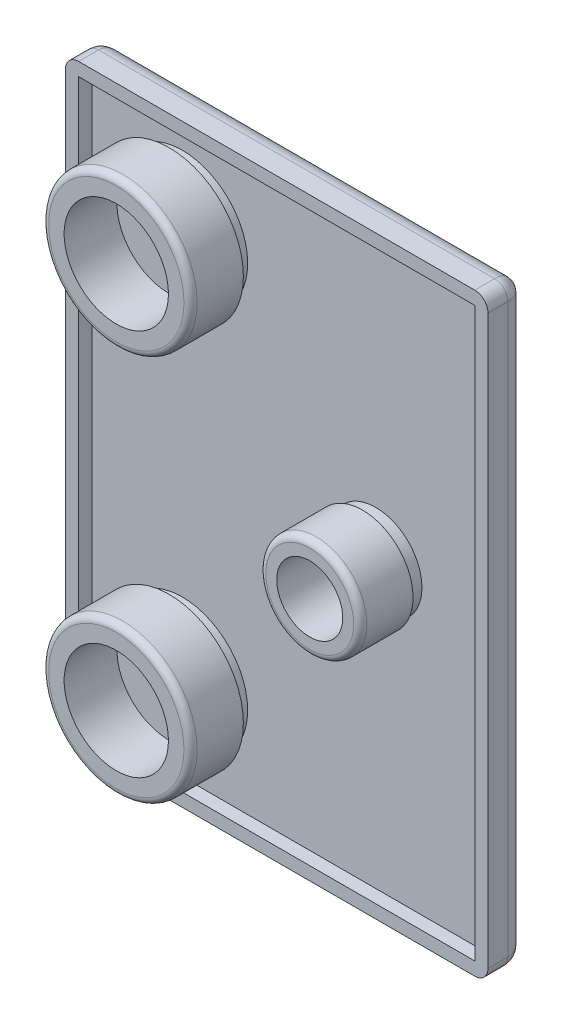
ISO-10303-21;
HEADER;
FILE_DESCRIPTION(('STEP AP214'),'2;1');
FILE_NAME('part.step','',(''),(''),'','','');
FILE_SCHEMA(('AUTOMOTIVE_DESIGN { 1 0 10303 214 1 1 1 1 }'));
ENDSEC;
DATA;
#1=APPLICATION_CONTEXT('core data for automotive mechanical design processes');
#2=APPLICATION_PROTOCOL_DEFINITION('international standard','automotive_design',2000,#1);
#3=PRODUCT_CONTEXT('',#1,'mechanical');
#4=PRODUCT('Part','Part','',(#3));
#5=PRODUCT_RELATED_PRODUCT_CATEGORY('part','',(#4));
#6=PRODUCT_DEFINITION_FORMATION('','',#4);
#7=PRODUCT_DEFINITION_CONTEXT('part definition',#1,'design');
#8=PRODUCT_DEFINITION('design','',#6,#7);
#9=PRODUCT_DEFINITION_SHAPE('','',#8);
#10=(LENGTH_UNIT() NAMED_UNIT(*) SI_UNIT(.MILLI.,.METRE.));
#11=(NAMED_UNIT(*) PLANE_ANGLE_UNIT() SI_UNIT($,.RADIAN.));
#12=(NAMED_UNIT(*) SI_UNIT($,.STERADIAN.) SOLID_ANGLE_UNIT());
#13=UNCERTAINTY_MEASURE_WITH_UNIT(LENGTH_MEASURE(1.E-05),#10,'distance_accuracy_value','');
#14=(GEOMETRIC_REPRESENTATION_CONTEXT(3) GLOBAL_UNCERTAINTY_ASSIGNED_CONTEXT((#13)) GLOBAL_UNIT_ASSIGNED_CONTEXT((#10,
#11,#12)) REPRESENTATION_CONTEXT('',''));
#15=CARTESIAN_POINT('',(0.,0.,0.));
#16=DIRECTION('',(0.,0.,1.));
#17=DIRECTION('',(1.,0.,0.));
#18=AXIS2_PLACEMENT_3D('',#15,#16,#17);
#19=CARTESIAN_POINT('',(-6.5,0.,3.));
#20=DIRECTION('',(0.,0.,1.));
#21=DIRECTION('',(1.,0.,0.));
#22=AXIS2_PLACEMENT_3D('',#19,#20,#21);
#23=PLANE('',#22);
#24=CARTESIAN_POINT('',(-14.65,14.65,3.));
#25=DIRECTION('',(0.,0.,1.));
#26=DIRECTION('',(1.,0.,0.));
#27=AXIS2_PLACEMENT_3D('',#24,#25,#26);
#28=CIRCLE('',#27,3.95);
#29=CARTESIAN_POINT('',(-10.7,14.65,3.));
#30=VERTEX_POINT('',#29);
#31=EDGE_CURVE('E23',#30,#30,#28,.T.);
#32=ORIENTED_EDGE('',*,*,#31,.T.);
#33=EDGE_LOOP('',(#32));
#34=FACE_BOUND('',#33,.T.);
#35=ADVANCED_FACE('F16',(#34),#23,.T.);
#36=CARTESIAN_POINT('',(-6.5,0.,3.));
#37=DIRECTION('',(0.,0.,1.));
#38=DIRECTION('',(1.,0.,0.));
#39=AXIS2_PLACEMENT_3D('',#36,#37,#38);
#40=PLANE('',#39);
#41=CARTESIAN_POINT('',(-14.65,-14.65,3.));
#42=DIRECTION('',(0.,0.,1.));
#43=DIRECTION('',(1.,0.,0.));
#44=AXIS2_PLACEMENT_3D('',#41,#42,#43);
#45=CIRCLE('',#44,3.95);
#46=CARTESIAN_POINT('',(-10.7,-14.65,3.));
#47=VERTEX_POINT('',#46);
#48=EDGE_CURVE('E38',#47,#47,#45,.T.);
#49=ORIENTED_EDGE('',*,*,#48,.T.);
#50=EDGE_LOOP('',(#49));
#51=FACE_BOUND('',#50,.T.);
#52=ADVANCED_FACE('F624',(#51),#40,.T.);
#53=CARTESIAN_POINT('',(-14.65,14.65,3.));
#54=DIRECTION('',(0.,0.,1.));
#55=DIRECTION('',(1.,0.,0.));
#56=AXIS2_PLACEMENT_3D('',#53,#54,#55);
#57=CYLINDRICAL_SURFACE('',#56,3.95);
#58=ORIENTED_EDGE('',*,*,#31,.F.);
#59=EDGE_LOOP('',(#58));
#60=FACE_BOUND('',#59,.T.);
#61=CARTESIAN_POINT('',(-14.65,14.65,7.));
#62=DIRECTION('',(0.,0.,1.));
#63=DIRECTION('',(1.,0.,0.));
#64=AXIS2_PLACEMENT_3D('',#61,#62,#63);
#65=CIRCLE('',#64,3.95);
#66=CARTESIAN_POINT('',(-10.7,14.65,7.));
#67=VERTEX_POINT('',#66);
#68=EDGE_CURVE('E619',#67,#67,#65,.T.);
#69=ORIENTED_EDGE('',*,*,#68,.T.);
#70=EDGE_LOOP('',(#69));
#71=FACE_BOUND('',#70,.T.);
#72=ADVANCED_FACE('F629',(#60,#71),#57,.F.);
#73=CARTESIAN_POINT('',(-14.65,-14.65,3.));
#74=DIRECTION('',(0.,0.,1.));
#75=DIRECTION('',(1.,0.,0.));
#76=AXIS2_PLACEMENT_3D('',#73,#74,#75);
#77=CYLINDRICAL_SURFACE('',#76,3.95);
#78=ORIENTED_EDGE('',*,*,#48,.F.);
#79=EDGE_LOOP('',(#78));
#80=FACE_BOUND('',#79,.T.);
#81=CARTESIAN_POINT('',(-14.65,-14.65,7.));
#82=DIRECTION('',(0.,0.,1.));
#83=DIRECTION('',(1.,0.,0.));
#84=AXIS2_PLACEMENT_3D('',#81,#82,#83);
#85=CIRCLE('',#84,3.95);
#86=CARTESIAN_POINT('',(-10.7,-14.65,7.));
#87=VERTEX_POINT('',#86);
#88=EDGE_CURVE('E615',#87,#87,#85,.T.);
#89=ORIENTED_EDGE('',*,*,#88,.T.);
#90=EDGE_LOOP('',(#89));
#91=FACE_BOUND('',#90,.T.);
#92=ADVANCED_FACE('F986',(#80,#91),#77,.F.);
#93=CARTESIAN_POINT('',(-14.65,14.65,7.));
#94=DIRECTION('',(0.,0.,-1.));
#95=DIRECTION('',(-1.,0.,0.));
#96=AXIS2_PLACEMENT_3D('',#93,#94,#95);
#97=PLANE('',#96);
#98=ORIENTED_EDGE('',*,*,#68,.F.);
#99=EDGE_LOOP('',(#98));
#100=FACE_BOUND('',#99,.T.);
#101=CARTESIAN_POINT('',(-14.65,14.65,7.));
#102=DIRECTION('',(0.,0.,-1.));
#103=DIRECTION('',(1.,0.,0.));
#104=AXIS2_PLACEMENT_3D('',#101,#102,#103);
#105=CIRCLE('',#104,5.125);
#106=CARTESIAN_POINT('',(-9.52499999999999,14.65,7.));
#107=VERTEX_POINT('',#106);
#108=EDGE_CURVE('E618',#107,#107,#105,.T.);
#109=ORIENTED_EDGE('',*,*,#108,.F.);
#110=EDGE_LOOP('',(#109));
#111=FACE_BOUND('',#110,.T.);
#112=ADVANCED_FACE('F977',(#100,#111),#97,.F.);
#113=CARTESIAN_POINT('',(-14.65,-14.65,7.));
#114=DIRECTION('',(0.,0.,-1.));
#115=DIRECTION('',(-1.,0.,0.));
#116=AXIS2_PLACEMENT_3D('',#113,#114,#115);
#117=PLANE('',#116);
#118=ORIENTED_EDGE('',*,*,#88,.F.);
#119=EDGE_LOOP('',(#118));
#120=FACE_BOUND('',#119,.T.);
#121=CARTESIAN_POINT('',(-14.65,-14.65,7.));
#122=DIRECTION('',(0.,0.,-1.));
#123=DIRECTION('',(1.,0.,0.));
#124=AXIS2_PLACEMENT_3D('',#121,#122,#123);
#125=CIRCLE('',#124,5.125);
#126=CARTESIAN_POINT('',(-9.52499999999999,-14.65,7.));
#127=VERTEX_POINT('',#126);
#128=EDGE_CURVE('E1073',#127,#127,#125,.T.);
#129=ORIENTED_EDGE('',*,*,#128,.F.);
#130=EDGE_LOOP('',(#129));
#131=FACE_BOUND('',#130,.T.);
#132=ADVANCED_FACE('F968',(#120,#131),#117,.F.);
#133=CARTESIAN_POINT('',(-14.65,14.65,6.5));
#134=DIRECTION('',(0.,0.,-1.));
#135=DIRECTION('',(-1.,0.,0.));
#136=AXIS2_PLACEMENT_3D('',#133,#134,#135);
#137=TOROIDAL_SURFACE('',#136,5.125,0.5);
#138=CARTESIAN_POINT('',(-14.65,14.65,6.5));
#139=DIRECTION('',(0.,0.,1.));
#140=DIRECTION('',(1.,0.,0.));
#141=AXIS2_PLACEMENT_3D('',#138,#139,#140);
#142=CIRCLE('',#141,5.625);
#143=CARTESIAN_POINT('',(-9.02499999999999,14.65,6.5));
#144=VERTEX_POINT('',#143);
#145=EDGE_CURVE('E1090',#144,#144,#142,.F.);
#146=ORIENTED_EDGE('',*,*,#145,.F.);
#147=EDGE_LOOP('',(#146));
#148=FACE_BOUND('',#147,.T.);
#149=ORIENTED_EDGE('',*,*,#108,.T.);
#150=EDGE_LOOP('',(#149));
#151=FACE_BOUND('',#150,.T.);
#152=ADVANCED_FACE('F959',(#148,#151),#137,.T.);
#153=CARTESIAN_POINT('',(-14.65,-14.65,6.5));
#154=DIRECTION('',(0.,0.,-1.));
#155=DIRECTION('',(-1.,0.,0.));
#156=AXIS2_PLACEMENT_3D('',#153,#154,#155);
#157=TOROIDAL_SURFACE('',#156,5.125,0.5);
#158=CARTESIAN_POINT('',(-14.65,-14.65,6.5));
#159=DIRECTION('',(0.,0.,1.));
#160=DIRECTION('',(1.,0.,0.));
#161=AXIS2_PLACEMENT_3D('',#158,#159,#160);
#162=CIRCLE('',#161,5.625);
#163=CARTESIAN_POINT('',(-9.02499999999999,-14.65,6.5));
#164=VERTEX_POINT('',#163);
#165=EDGE_CURVE('E614',#164,#164,#162,.F.);
#166=ORIENTED_EDGE('',*,*,#165,.F.);
#167=EDGE_LOOP('',(#166));
#168=FACE_BOUND('',#167,.T.);
#169=ORIENTED_EDGE('',*,*,#128,.T.);
#170=EDGE_LOOP('',(#169));
#171=FACE_BOUND('',#170,.T.);
#172=ADVANCED_FACE('F950',(#168,#171),#157,.T.);
#173=CARTESIAN_POINT('',(-14.65,14.65,3.));
#174=DIRECTION('',(0.,0.,1.));
#175=DIRECTION('',(1.,0.,0.));
#176=AXIS2_PLACEMENT_3D('',#173,#174,#175);
#177=CYLINDRICAL_SURFACE('',#176,5.625);
#178=ORIENTED_EDGE('',*,*,#145,.T.);
#179=EDGE_LOOP('',(#178));
#180=FACE_BOUND('',#179,.T.);
#181=CARTESIAN_POINT('',(-14.65,14.65,3.));
#182=DIRECTION('',(0.,0.,1.));
#183=DIRECTION('',(1.,0.,0.));
#184=AXIS2_PLACEMENT_3D('',#181,#182,#183);
#185=CIRCLE('',#184,5.625);
#186=CARTESIAN_POINT('',(-9.02499999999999,14.65,3.));
#187=VERTEX_POINT('',#186);
#188=EDGE_CURVE('E611',#187,#187,#185,.T.);
#189=ORIENTED_EDGE('',*,*,#188,.T.);
#190=EDGE_LOOP('',(#189));
#191=FACE_BOUND('',#190,.T.);
#192=ADVANCED_FACE('F941',(#180,#191),#177,.T.);
#193=CARTESIAN_POINT('',(-14.65,-14.65,3.));
#194=DIRECTION('',(0.,0.,1.));
#195=DIRECTION('',(1.,0.,0.));
#196=AXIS2_PLACEMENT_3D('',#193,#194,#195);
#197=CYLINDRICAL_SURFACE('',#196,5.625);
#198=ORIENTED_EDGE('',*,*,#165,.T.);
#199=EDGE_LOOP('',(#198));
#200=FACE_BOUND('',#199,.T.);
#201=CARTESIAN_POINT('',(-14.65,-14.65,3.));
#202=DIRECTION('',(0.,0.,1.));
#203=DIRECTION('',(1.,0.,0.));
#204=AXIS2_PLACEMENT_3D('',#201,#202,#203);
#205=CIRCLE('',#204,5.625);
#206=CARTESIAN_POINT('',(-9.02499999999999,-14.65,3.));
#207=VERTEX_POINT('',#206);
#208=EDGE_CURVE('E608',#207,#207,#205,.T.);
#209=ORIENTED_EDGE('',*,*,#208,.T.);
#210=EDGE_LOOP('',(#209));
#211=FACE_BOUND('',#210,.T.);
#212=ADVANCED_FACE('F932',(#200,#211),#197,.T.);
#213=CARTESIAN_POINT('',(-6.5,0.,3.));
#214=DIRECTION('',(0.,0.,1.));
#215=DIRECTION('',(1.,0.,0.));
#216=AXIS2_PLACEMENT_3D('',#213,#214,#215);
#217=PLANE('',#216);
#218=CARTESIAN_POINT('',(-14.65,14.65,3.));
#219=DIRECTION('',(0.,0.,1.));
#220=DIRECTION('',(1.,0.,0.));
#221=AXIS2_PLACEMENT_3D('',#218,#219,#220);
#222=CIRCLE('',#221,4.95);
#223=CARTESIAN_POINT('',(-9.69999999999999,14.65,3.));
#224=VERTEX_POINT('',#223);
#225=EDGE_CURVE('E606',#224,#224,#222,.F.);
#226=ORIENTED_EDGE('',*,*,#225,.F.);
#227=EDGE_LOOP('',(#226));
#228=FACE_BOUND('',#227,.T.);
#229=ORIENTED_EDGE('',*,*,#188,.F.);
#230=EDGE_LOOP('',(#229));
#231=FACE_BOUND('',#230,.T.);
#232=ADVANCED_FACE('F923',(#228,#231),#217,.F.);
#233=CARTESIAN_POINT('',(-6.5,0.,3.));
#234=DIRECTION('',(0.,0.,1.));
#235=DIRECTION('',(1.,0.,0.));
#236=AXIS2_PLACEMENT_3D('',#233,#234,#235);
#237=PLANE('',#236);
#238=CARTESIAN_POINT('',(-14.65,-14.65,3.));
#239=DIRECTION('',(0.,0.,1.));
#240=DIRECTION('',(1.,0.,0.));
#241=AXIS2_PLACEMENT_3D('',#238,#239,#240);
#242=CIRCLE('',#241,4.95);
#243=CARTESIAN_POINT('',(-9.69999999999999,-14.65,3.));
#244=VERTEX_POINT('',#243);
#245=EDGE_CURVE('E604',#244,#244,#242,.F.);
#246=ORIENTED_EDGE('',*,*,#245,.F.);
#247=EDGE_LOOP('',(#246));
#248=FACE_BOUND('',#247,.T.);
#249=ORIENTED_EDGE('',*,*,#208,.F.);
#250=EDGE_LOOP('',(#249));
#251=FACE_BOUND('',#250,.T.);
#252=ADVANCED_FACE('F914',(#248,#251),#237,.F.);
#253=CARTESIAN_POINT('',(-14.65,14.65,3.));
#254=DIRECTION('',(0.,0.,1.));
#255=DIRECTION('',(1.,0.,0.));
#256=AXIS2_PLACEMENT_3D('',#253,#254,#255);
#257=CYLINDRICAL_SURFACE('',#256,4.95);
#258=CARTESIAN_POINT('',(-14.65,14.65,2.));
#259=DIRECTION('',(0.,0.,1.));
#260=DIRECTION('',(1.,0.,0.));
#261=AXIS2_PLACEMENT_3D('',#258,#259,#260);
#262=CIRCLE('',#261,4.95);
#263=CARTESIAN_POINT('',(-9.69999999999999,14.65,2.));
#264=VERTEX_POINT('',#263);
#265=EDGE_CURVE('E600',#264,#264,#262,.F.);
#266=ORIENTED_EDGE('',*,*,#265,.F.);
#267=EDGE_LOOP('',(#266));
#268=FACE_BOUND('',#267,.T.);
#269=ORIENTED_EDGE('',*,*,#225,.T.);
#270=EDGE_LOOP('',(#269));
#271=FACE_BOUND('',#270,.T.);
#272=ADVANCED_FACE('F905',(#268,#271),#257,.T.);
#273=CARTESIAN_POINT('',(-14.65,-14.65,3.));
#274=DIRECTION('',(0.,0.,1.));
#275=DIRECTION('',(1.,0.,0.));
#276=AXIS2_PLACEMENT_3D('',#273,#274,#275);
#277=CYLINDRICAL_SURFACE('',#276,4.95);
#278=CARTESIAN_POINT('',(-14.65,-14.65,2.));
#279=DIRECTION('',(0.,0.,1.));
#280=DIRECTION('',(1.,0.,0.));
#281=AXIS2_PLACEMENT_3D('',#278,#279,#280);
#282=CIRCLE('',#281,4.95);
#283=CARTESIAN_POINT('',(-9.69999999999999,-14.65,2.));
#284=VERTEX_POINT('',#283);
#285=EDGE_CURVE('E598',#284,#284,#282,.F.);
#286=ORIENTED_EDGE('',*,*,#285,.F.);
#287=EDGE_LOOP('',(#286));
#288=FACE_BOUND('',#287,.T.);
#289=ORIENTED_EDGE('',*,*,#245,.T.);
#290=EDGE_LOOP('',(#289));
#291=FACE_BOUND('',#290,.T.);
#292=ADVANCED_FACE('F896',(#288,#291),#277,.T.);
#293=CARTESIAN_POINT('',(0.,0.,3.));
#294=DIRECTION('',(0.,0.,1.));
#295=DIRECTION('',(1.,0.,0.));
#296=AXIS2_PLACEMENT_3D('',#293,#294,#295);
#297=CYLINDRICAL_SURFACE('',#296,3.5);
#298=CARTESIAN_POINT('',(0.,0.,2.));
#299=DIRECTION('',(0.,0.,1.));
#300=DIRECTION('',(1.,0.,0.));
#301=AXIS2_PLACEMENT_3D('',#298,#299,#300);
#302=CIRCLE('',#301,3.5);
#303=CARTESIAN_POINT('',(3.5,0.,2.));
#304=VERTEX_POINT('',#303);
#305=EDGE_CURVE('E602',#304,#304,#302,.F.);
#306=ORIENTED_EDGE('',*,*,#305,.F.);
#307=EDGE_LOOP('',(#306));
#308=FACE_BOUND('',#307,.T.);
#309=CARTESIAN_POINT('',(0.,0.,3.));
#310=DIRECTION('',(0.,0.,1.));
#311=DIRECTION('',(1.,0.,0.));
#312=AXIS2_PLACEMENT_3D('',#309,#310,#311);
#313=CIRCLE('',#312,3.5);
#314=CARTESIAN_POINT('',(3.5,0.,3.));
#315=VERTEX_POINT('',#314);
#316=EDGE_CURVE('E594',#315,#315,#313,.F.);
#317=ORIENTED_EDGE('',*,*,#316,.T.);
#318=EDGE_LOOP('',(#317));
#319=FACE_BOUND('',#318,.T.);
#320=ADVANCED_FACE('F887',(#308,#319),#297,.T.);
#321=CARTESIAN_POINT('',(-6.5,0.,2.));
#322=DIRECTION('',(0.,0.,1.));
#323=DIRECTION('',(1.,0.,0.));
#324=AXIS2_PLACEMENT_3D('',#321,#322,#323);
#325=PLANE('',#324);
#326=ORIENTED_EDGE('',*,*,#285,.T.);
#327=EDGE_LOOP('',(#326));
#328=FACE_BOUND('',#327,.T.);
#329=ORIENTED_EDGE('',*,*,#265,.T.);
#330=EDGE_LOOP('',(#329));
#331=FACE_BOUND('',#330,.T.);
#332=ORIENTED_EDGE('',*,*,#305,.T.);
#333=EDGE_LOOP('',(#332));
#334=FACE_BOUND('',#333,.T.);
#335=DIRECTION('',(0.,1.,0.));
#336=VECTOR('',#335,1.);
#337=CARTESIAN_POINT('',(-21.5,-22.5,2.));
#338=LINE('',#337,#336);
#339=CARTESIAN_POINT('',(-21.5,21.5,2.));
#340=VERTEX_POINT('',#339);
#341=CARTESIAN_POINT('',(-21.5,-21.5,2.));
#342=VERTEX_POINT('',#341);
#343=EDGE_CURVE('E1108',#340,#342,#338,.F.);
#344=ORIENTED_EDGE('',*,*,#343,.T.);
#345=DIRECTION('',(1.,0.,0.));
#346=VECTOR('',#345,1.);
#347=CARTESIAN_POINT('',(9.5,-21.5,2.));
#348=LINE('',#347,#346);
#349=CARTESIAN_POINT('',(8.5,-21.5,2.));
#350=VERTEX_POINT('',#349);
#351=EDGE_CURVE('E1102',#342,#350,#348,.T.);
#352=ORIENTED_EDGE('',*,*,#351,.T.);
#353=DIRECTION('',(0.,1.,0.));
#354=VECTOR('',#353,1.);
#355=CARTESIAN_POINT('',(8.5,22.5,2.));
#356=LINE('',#355,#354);
#357=CARTESIAN_POINT('',(8.5,21.5,2.));
#358=VERTEX_POINT('',#357);
#359=EDGE_CURVE('E597',#350,#358,#356,.T.);
#360=ORIENTED_EDGE('',*,*,#359,.T.);
#361=DIRECTION('',(1.,0.,0.));
#362=VECTOR('',#361,1.);
#363=CARTESIAN_POINT('',(-22.5,21.5,2.));
#364=LINE('',#363,#362);
#365=EDGE_CURVE('E593',#358,#340,#364,.F.);
#366=ORIENTED_EDGE('',*,*,#365,.T.);
#367=EDGE_LOOP('',(#344,#352,#360,#366));
#368=FACE_BOUND('',#367,.T.);
#369=ADVANCED_FACE('F878',(#328,#331,#334,#368),#325,.T.);
#370=CARTESIAN_POINT('',(-6.5,0.,3.));
#371=DIRECTION('',(0.,0.,1.));
#372=DIRECTION('',(1.,0.,0.));
#373=AXIS2_PLACEMENT_3D('',#370,#371,#372);
#374=PLANE('',#373);
#375=ORIENTED_EDGE('',*,*,#316,.F.);
#376=EDGE_LOOP('',(#375));
#377=FACE_BOUND('',#376,.T.);
#378=CARTESIAN_POINT('',(0.,0.,3.));
#379=DIRECTION('',(0.,0.,1.));
#380=DIRECTION('',(1.,0.,0.));
#381=AXIS2_PLACEMENT_3D('',#378,#379,#380);
#382=CIRCLE('',#381,3.825);
#383=CARTESIAN_POINT('',(3.825,0.,3.));
#384=VERTEX_POINT('',#383);
#385=EDGE_CURVE('E591',#384,#384,#382,.T.);
#386=ORIENTED_EDGE('',*,*,#385,.F.);
#387=EDGE_LOOP('',(#386));
#388=FACE_BOUND('',#387,.T.);
#389=ADVANCED_FACE('F869',(#377,#388),#374,.F.);
#390=CARTESIAN_POINT('',(8.5,22.5,0.));
#391=DIRECTION('',(1.,0.,0.));
#392=DIRECTION('',(0.,0.,-1.));
#393=AXIS2_PLACEMENT_3D('',#390,#391,#392);
#394=PLANE('',#393);
#395=DIRECTION('',(0.,0.,-1.));
#396=VECTOR('',#395,1.);
#397=CARTESIAN_POINT('',(8.5,-21.5,0.));
#398=LINE('',#397,#396);
#399=CARTESIAN_POINT('',(8.5,-21.5,3.));
#400=VERTEX_POINT('',#399);
#401=EDGE_CURVE('E1099',#350,#400,#398,.F.);
#402=ORIENTED_EDGE('',*,*,#401,.T.);
#403=DIRECTION('',(0.,1.,0.));
#404=VECTOR('',#403,1.);
#405=CARTESIAN_POINT('',(8.5,0.,3.));
#406=LINE('',#405,#404);
#407=CARTESIAN_POINT('',(8.5,21.5,3.));
#408=VERTEX_POINT('',#407);
#409=EDGE_CURVE('E465',#408,#400,#406,.F.);
#410=ORIENTED_EDGE('',*,*,#409,.F.);
#411=DIRECTION('',(0.,0.,1.));
#412=VECTOR('',#411,1.);
#413=CARTESIAN_POINT('',(8.5,21.5,0.));
#414=LINE('',#413,#412);
#415=EDGE_CURVE('E1114',#408,#358,#414,.F.);
#416=ORIENTED_EDGE('',*,*,#415,.T.);
#417=ORIENTED_EDGE('',*,*,#359,.F.);
#418=EDGE_LOOP('',(#402,#410,#416,#417));
#419=FACE_BOUND('',#418,.T.);
#420=ADVANCED_FACE('F860',(#419),#394,.F.);
#421=CARTESIAN_POINT('',(9.5,-21.5,0.));
#422=DIRECTION('',(0.,-1.,0.));
#423=DIRECTION('',(0.,0.,-1.));
#424=AXIS2_PLACEMENT_3D('',#421,#422,#423);
#425=PLANE('',#424);
#426=DIRECTION('',(0.,0.,1.));
#427=VECTOR('',#426,1.);
#428=CARTESIAN_POINT('',(-21.5,-21.5,0.));
#429=LINE('',#428,#427);
#430=CARTESIAN_POINT('',(-21.5,-21.5,3.));
#431=VERTEX_POINT('',#430);
#432=EDGE_CURVE('E1105',#342,#431,#429,.T.);
#433=ORIENTED_EDGE('',*,*,#432,.T.);
#434=DIRECTION('',(1.,0.,0.));
#435=VECTOR('',#434,1.);
#436=CARTESIAN_POINT('',(-6.5,-21.5,3.));
#437=LINE('',#436,#435);
#438=EDGE_CURVE('E463',#400,#431,#437,.F.);
#439=ORIENTED_EDGE('',*,*,#438,.F.);
#440=ORIENTED_EDGE('',*,*,#401,.F.);
#441=ORIENTED_EDGE('',*,*,#351,.F.);
#442=EDGE_LOOP('',(#433,#439,#440,#441));
#443=FACE_BOUND('',#442,.T.);
#444=ADVANCED_FACE('F851',(#443),#425,.F.);
#445=CARTESIAN_POINT('',(-21.5,-22.5,0.));
#446=DIRECTION('',(-1.,0.,0.));
#447=DIRECTION('',(0.,0.,1.));
#448=AXIS2_PLACEMENT_3D('',#445,#446,#447);
#449=PLANE('',#448);
#450=DIRECTION('',(0.,0.,1.));
#451=VECTOR('',#450,1.);
#452=CARTESIAN_POINT('',(-21.5,21.5,0.));
#453=LINE('',#452,#451);
#454=CARTESIAN_POINT('',(-21.5,21.5,3.));
#455=VERTEX_POINT('',#454);
#456=EDGE_CURVE('E1111',#340,#455,#453,.T.);
#457=ORIENTED_EDGE('',*,*,#456,.T.);
#458=DIRECTION('',(0.,1.,0.));
#459=VECTOR('',#458,1.);
#460=CARTESIAN_POINT('',(-21.5,0.,3.));
#461=LINE('',#460,#459);
#462=EDGE_CURVE('E461',#431,#455,#461,.T.);
#463=ORIENTED_EDGE('',*,*,#462,.F.);
#464=ORIENTED_EDGE('',*,*,#432,.F.);
#465=ORIENTED_EDGE('',*,*,#343,.F.);
#466=EDGE_LOOP('',(#457,#463,#464,#465));
#467=FACE_BOUND('',#466,.T.);
#468=ADVANCED_FACE('F842',(#467),#449,.F.);
#469=CARTESIAN_POINT('',(-22.5,21.5,0.));
#470=DIRECTION('',(0.,1.,0.));
#471=DIRECTION('',(0.,0.,1.));
#472=AXIS2_PLACEMENT_3D('',#469,#470,#471);
#473=PLANE('',#472);
#474=ORIENTED_EDGE('',*,*,#415,.F.);
#475=DIRECTION('',(1.,0.,0.));
#476=VECTOR('',#475,1.);
#477=CARTESIAN_POINT('',(-6.5,21.5,3.));
#478=LINE('',#477,#476);
#479=EDGE_CURVE('E457',#455,#408,#478,.T.);
#480=ORIENTED_EDGE('',*,*,#479,.F.);
#481=ORIENTED_EDGE('',*,*,#456,.F.);
#482=ORIENTED_EDGE('',*,*,#365,.F.);
#483=EDGE_LOOP('',(#474,#480,#481,#482));
#484=FACE_BOUND('',#483,.T.);
#485=ADVANCED_FACE('F834',(#484),#473,.F.);
#486=CARTESIAN_POINT('',(0.,0.,3.));
#487=DIRECTION('',(0.,0.,1.));
#488=DIRECTION('',(1.,0.,0.));
#489=AXIS2_PLACEMENT_3D('',#486,#487,#488);
#490=CYLINDRICAL_SURFACE('',#489,3.825);
#491=CARTESIAN_POINT('',(0.,0.,6.5));
#492=DIRECTION('',(0.,0.,-1.));
#493=DIRECTION('',(-1.,0.,0.));
#494=AXIS2_PLACEMENT_3D('',#491,#492,#493);
#495=CIRCLE('',#494,3.825);
#496=CARTESIAN_POINT('',(3.825,0.,6.5));
#497=VERTEX_POINT('',#496);
#498=EDGE_CURVE('E413',#497,#497,#495,.F.);
#499=ORIENTED_EDGE('',*,*,#498,.F.);
#500=EDGE_LOOP('',(#499));
#501=FACE_BOUND('',#500,.T.);
#502=ORIENTED_EDGE('',*,*,#385,.T.);
#503=EDGE_LOOP('',(#502));
#504=FACE_BOUND('',#503,.T.);
#505=ADVANCED_FACE('F827',(#501,#504),#490,.T.);
#506=CARTESIAN_POINT('',(-21.5,-21.5,0.));
#507=DIRECTION('',(0.,0.,1.));
#508=DIRECTION('',(1.,0.,0.));
#509=AXIS2_PLACEMENT_3D('',#506,#507,#508);
#510=CYLINDRICAL_SURFACE('',#509,1.);
#511=CARTESIAN_POINT('',(-21.5,-21.5,3.));
#512=DIRECTION('',(0.,0.,1.));
#513=DIRECTION('',(1.,0.,0.));
#514=AXIS2_PLACEMENT_3D('',#511,#512,#513);
#515=CIRCLE('',#514,1.);
#516=CARTESIAN_POINT('',(-22.5,-21.5,3.));
#517=VERTEX_POINT('',#516);
#518=CARTESIAN_POINT('',(-21.5,-22.5,3.));
#519=VERTEX_POINT('',#518);
#520=EDGE_CURVE('E589',#517,#519,#515,.T.);
#521=ORIENTED_EDGE('',*,*,#520,.F.);
#522=DIRECTION('',(0.,0.,1.));
#523=VECTOR('',#522,1.);
#524=CARTESIAN_POINT('',(-22.5,-21.5,0.));
#525=LINE('',#524,#523);
#526=CARTESIAN_POINT('',(-22.5,-21.5,1.5));
#527=VERTEX_POINT('',#526);
#528=EDGE_CURVE('E573',#527,#517,#525,.T.);
#529=ORIENTED_EDGE('',*,*,#528,.F.);
#530=CARTESIAN_POINT('',(-21.5,-22.5,1.5));
#531=CARTESIAN_POINT('',(-21.5130898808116,-22.5000000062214,1.5));
#532=CARTESIAN_POINT('',(-21.5261796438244,-22.4997405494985,1.5));
#533=CARTESIAN_POINT('',(-21.5523387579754,-22.4987061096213,1.5));
#534=CARTESIAN_POINT('',(-21.5654081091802,-22.4979311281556,1.5));
#535=CARTESIAN_POINT('',(-21.5915064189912,-22.4958690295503,1.5));
#536=CARTESIAN_POINT('',(-21.6045353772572,-22.4945819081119,1.5));
#537=CARTESIAN_POINT('',(-21.6305330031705,-22.4914989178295,1.5));
#538=CARTESIAN_POINT('',(-21.6435016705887,-22.4897030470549,1.5));
#539=CARTESIAN_POINT('',(-21.669358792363,-22.4856059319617,1.5));
#540=CARTESIAN_POINT('',(-21.6822472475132,-22.4833046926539,1.5));
#541=CARTESIAN_POINT('',(-21.7079240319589,-22.4782002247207,1.5));
#542=CARTESIAN_POINT('',(-21.7207123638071,-22.4753970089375,1.5));
#543=CARTESIAN_POINT('',(-21.746168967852,-22.4692919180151,1.5));
#544=CARTESIAN_POINT('',(-21.7588372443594,-22.4659900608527,1.5));
#545=CARTESIAN_POINT('',(-21.7840338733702,-22.4588912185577,1.5));
#546=CARTESIAN_POINT('',(-21.7965622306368,-22.4550942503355,1.5));
#547=CARTESIAN_POINT('',(-21.8214588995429,-22.447007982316,1.5));
#548=CARTESIAN_POINT('',(-21.8338272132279,-22.442718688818,1.5));
#549=CARTESIAN_POINT('',(-21.8583846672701,-22.4336539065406,1.5));
#550=CARTESIAN_POINT('',(-21.8705738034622,-22.4288784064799,1.5));
#551=CARTESIAN_POINT('',(-21.8947554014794,-22.418851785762,1.5));
#552=CARTESIAN_POINT('',(-21.9067478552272,-22.4136006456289,1.5));
#553=CARTESIAN_POINT('',(-21.9305182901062,-22.402632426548,1.5));
#554=CARTESIAN_POINT('',(-21.9422962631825,-22.396915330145,1.5));
#555=CARTESIAN_POINT('',(-21.9656200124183,-22.3850251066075,1.5));
#556=CARTESIAN_POINT('',(-21.9771657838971,-22.3788519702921,1.5));
#557=CARTESIAN_POINT('',(-22.0000073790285,-22.3660595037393,1.5));
#558=CARTESIAN_POINT('',(-22.0113032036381,-22.3594401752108,1.5));
#559=CARTESIAN_POINT('',(-22.0336271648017,-22.3457651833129,1.5));
#560=CARTESIAN_POINT('',(-22.0446553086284,-22.3387095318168,1.5));
#561=CARTESIAN_POINT('',(-22.066426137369,-22.3241717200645,1.5));
#562=CARTESIAN_POINT('',(-22.0771688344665,-22.3166895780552,1.5));
#563=CARTESIAN_POINT('',(-22.0983511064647,-22.3013087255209,1.5));
#564=CARTESIAN_POINT('',(-22.1087906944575,-22.2934100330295,1.5));
#565=CARTESIAN_POINT('',(-22.1293486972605,-22.2772056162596,1.5));
#566=CARTESIAN_POINT('',(-22.1394671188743,-22.2688999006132,1.5));
#567=CARTESIAN_POINT('',(-22.1593686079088,-22.2518957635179,1.5));
#568=CARTESIAN_POINT('',(-22.1691516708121,-22.243197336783,1.5));
#569=CARTESIAN_POINT('',(-22.1883689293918,-22.2254227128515,1.5));
#570=CARTESIAN_POINT('',(-22.1978031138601,-22.2163465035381,1.5));
#571=CARTESIAN_POINT('',(-22.2163089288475,-22.1978310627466,1.5));
#572=CARTESIAN_POINT('',(-22.2253805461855,-22.1883918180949,1.5));
#573=CARTESIAN_POINT('',(-22.2431475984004,-22.1691651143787,1.5));
#574=CARTESIAN_POINT('',(-22.2518430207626,-22.1593776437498,1.5));
#575=CARTESIAN_POINT('',(-22.2688439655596,-22.1394692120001,1.5));
#576=CARTESIAN_POINT('',(-22.2771494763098,-22.1293482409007,1.5));
#577=CARTESIAN_POINT('',(-22.2933571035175,-22.108787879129,1.5));
#578=CARTESIAN_POINT('',(-22.3012592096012,-22.0983484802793,1.5));
#579=CARTESIAN_POINT('',(-22.3166484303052,-22.0771681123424,1.5));
#580=CARTESIAN_POINT('',(-22.3241355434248,-22.066427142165,1.5));
#581=CARTESIAN_POINT('',(-22.3386829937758,-22.0446603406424,1.5));
#582=CARTESIAN_POINT('',(-22.3457433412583,-22.0336345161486,1.5));
#583=CARTESIAN_POINT('',(-22.3594254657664,-22.0113147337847,1.5));
#584=CARTESIAN_POINT('',(-22.3660472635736,-22.0000207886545,1.5));
#585=CARTESIAN_POINT('',(-22.3788406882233,-21.9771815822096,1.5));
#586=CARTESIAN_POINT('',(-22.385012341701,-21.965636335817,1.5));
#587=CARTESIAN_POINT('',(-22.3968931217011,-21.9423109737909,1.5));
#588=CARTESIAN_POINT('',(-22.4026022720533,-21.9305308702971,1.5));
#589=CARTESIAN_POINT('',(-22.4135491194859,-21.9067538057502,1.5));
#590=CARTESIAN_POINT('',(-22.4187868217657,-21.8947568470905,1.5));
#591=CARTESIAN_POINT('',(-22.4287866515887,-21.8705659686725,1.5));
#592=CARTESIAN_POINT('',(-22.4335487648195,-21.8583720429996,1.5));
#593=CARTESIAN_POINT('',(-22.4425923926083,-21.8338066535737,1.5));
#594=CARTESIAN_POINT('',(-22.4468738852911,-21.8214351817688,1.5));
#595=CARTESIAN_POINT('',(-22.4549514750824,-21.7965342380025,1.5));
#596=CARTESIAN_POINT('',(-22.4587475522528,-21.7840047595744,1.5));
#597=CARTESIAN_POINT('',(-22.4658494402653,-21.7588073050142,1.5));
#598=CARTESIAN_POINT('',(-22.4691552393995,-21.7461393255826,1.5));
#599=CARTESIAN_POINT('',(-22.475271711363,-21.720684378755,1.5));
#600=CARTESIAN_POINT('',(-22.4780823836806,-21.707897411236,1.5));
#601=CARTESIAN_POINT('',(-22.4832037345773,-21.6822239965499,1.5));
#602=CARTESIAN_POINT('',(-22.4855144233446,-21.6693375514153,1.5));
#603=CARTESIAN_POINT('',(-22.489630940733,-21.6434846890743,1.5));
#604=CARTESIAN_POINT('',(-22.4914367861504,-21.6305182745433,1.5));
#605=CARTESIAN_POINT('',(-22.4945387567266,-21.6045249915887,1.5));
#606=CARTESIAN_POINT('',(-22.4958348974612,-21.5914981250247,1.5));
#607=CARTESIAN_POINT('',(-22.4979125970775,-21.5654034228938,1.5));
#608=CARTESIAN_POINT('',(-22.4986941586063,-21.5523355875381,1.5));
#609=CARTESIAN_POINT('',(-22.4997378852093,-21.5261785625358,1.5));
#610=CARTESIAN_POINT('',(-22.5000000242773,-21.5130893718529,1.5));
#611=CARTESIAN_POINT('',(-22.5,-21.5,1.5));
#612=B_SPLINE_CURVE_WITH_KNOTS('',3,(#530,#531,#532,#533,#534,#535,#536,#537,#538,#539,#540,
#541,#542,#543,#544,#545,#546,#547,#548,#549,#550,#551,#552,#553,#554,#555,#556,#557,#558,#559,
#560,#561,#562,#563,#564,#565,#566,#567,#568,#569,#570,#571,#572,#573,#574,#575,#576,#577,#578,
#579,#580,#581,#582,#583,#584,#585,#586,#587,#588,#589,#590,#591,#592,#593,#594,#595,#596,#597,
#598,#599,#600,#601,#602,#603,#604,#605,#606,#607,#608,#609,#610,#611),.UNSPECIFIED.,.F.,.F.,(4,
2,2,2,2,2,2,2,2,2,2,2,2,2,2,2,2,2,2,2,2,2,2,2,2,2,2,2,2,2,2,2,2,2,2,2,2,2,2,2,4),(0.,
0.0392669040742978,0.0785336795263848,0.11780078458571,0.1570680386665,0.196334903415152,
0.235600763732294,0.274865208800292,0.31412831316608,0.353390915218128,0.39265442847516,
0.431919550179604,0.471186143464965,0.510453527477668,0.549720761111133,0.588986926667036,
0.628251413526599,0.667514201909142,0.706776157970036,0.746038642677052,0.785302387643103,
0.824567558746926,0.863834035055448,0.903101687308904,0.942370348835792,0.981639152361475,
1.02090701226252,1.06017301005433,1.09943668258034,1.13869833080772,1.17795954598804,
1.21722194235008,1.25648612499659,1.2957519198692,1.33501865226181,1.37428542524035,
1.4135513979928,1.45281606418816,1.49207953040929,1.53134279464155,1.57060802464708),.UNSPECIFIED.);
#613=CARTESIAN_POINT('',(-21.5000000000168,-22.5,1.5));
#614=VERTEX_POINT('',#613);
#615=EDGE_CURVE('E528',#614,#527,#612,.T.);
#616=ORIENTED_EDGE('',*,*,#615,.F.);
#617=DIRECTION('',(0.,0.,-1.));
#618=VECTOR('',#617,1.);
#619=CARTESIAN_POINT('',(-21.5,-22.5,0.));
#620=LINE('',#619,#618);
#621=EDGE_CURVE('E523',#519,#614,#620,.T.);
#622=ORIENTED_EDGE('',*,*,#621,.F.);
#623=EDGE_LOOP('',(#521,#529,#616,#622));
#624=FACE_BOUND('',#623,.T.);
#625=ADVANCED_FACE('F500',(#624),#510,.T.);
#626=CARTESIAN_POINT('',(8.5,-21.5,0.));
#627=DIRECTION('',(0.,0.,1.));
#628=DIRECTION('',(1.,0.,0.));
#629=AXIS2_PLACEMENT_3D('',#626,#627,#628);
#630=CYLINDRICAL_SURFACE('',#629,1.);
#631=CARTESIAN_POINT('',(8.5,-21.5,3.));
#632=DIRECTION('',(0.,0.,1.));
#633=DIRECTION('',(1.,0.,0.));
#634=AXIS2_PLACEMENT_3D('',#631,#632,#633);
#635=CIRCLE('',#634,1.);
#636=CARTESIAN_POINT('',(8.5,-22.5,3.));
#637=VERTEX_POINT('',#636);
#638=CARTESIAN_POINT('',(9.5,-21.5,3.));
#639=VERTEX_POINT('',#638);
#640=EDGE_CURVE('E587',#637,#639,#635,.T.);
#641=ORIENTED_EDGE('',*,*,#640,.F.);
#642=DIRECTION('',(0.,0.,-1.));
#643=VECTOR('',#642,1.);
#644=CARTESIAN_POINT('',(8.5,-22.5,0.));
#645=LINE('',#644,#643);
#646=CARTESIAN_POINT('',(8.5,-22.5,1.5));
#647=VERTEX_POINT('',#646);
#648=EDGE_CURVE('E524',#647,#637,#645,.F.);
#649=ORIENTED_EDGE('',*,*,#648,.F.);
#650=CARTESIAN_POINT('',(9.5,-21.5,1.5));
#651=CARTESIAN_POINT('',(9.50000000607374,-21.5130898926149,1.5));
#652=CARTESIAN_POINT('',(9.49974055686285,-21.5261796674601,1.5));
#653=CARTESIAN_POINT('',(9.4987061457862,-21.5523388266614,1.5));
#654=CARTESIAN_POINT('',(9.49793118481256,-21.5654082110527,1.5));
#655=CARTESIAN_POINT('',(9.4958691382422,-21.5915066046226,1.5));
#656=CARTESIAN_POINT('',(9.49458204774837,-21.6045356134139,1.5));
#657=CARTESIAN_POINT('',(9.491499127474,-21.6305333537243,1.5));
#658=CARTESIAN_POINT('',(9.48970329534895,-21.6435020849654,1.5));
#659=CARTESIAN_POINT('',(9.48560626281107,-21.6693593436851,1.5));
#660=CARTESIAN_POINT('',(9.48330506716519,-21.682247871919,1.5));
#661=CARTESIAN_POINT('',(9.47820068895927,-21.7079248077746,1.5));
#662=CARTESIAN_POINT('',(9.47539751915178,-21.7207132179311,1.5));
#663=CARTESIAN_POINT('',(9.46929251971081,-21.746169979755,1.5));
#664=CARTESIAN_POINT('',(9.46599070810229,-21.7588383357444,1.5));
#665=CARTESIAN_POINT('',(9.45889195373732,-21.7840351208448,1.5));
#666=CARTESIAN_POINT('',(9.45509502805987,-21.7965635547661,1.5));
#667=CARTESIAN_POINT('',(9.44700883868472,-21.8214603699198,1.5));
#668=CARTESIAN_POINT('',(9.44271958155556,-21.8338287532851,1.5));
#669=CARTESIAN_POINT('',(9.43365486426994,-21.8583863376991,1.5));
#670=CARTESIAN_POINT('',(9.4288793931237,-21.8705755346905,1.5));
#671=CARTESIAN_POINT('',(9.41885282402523,-21.8947572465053,1.5));
#672=CARTESIAN_POINT('',(9.41360170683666,-21.9067497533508,1.5));
#673=CARTESIAN_POINT('',(9.40263352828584,-21.9305202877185,1.5));
#674=CARTESIAN_POINT('',(9.39691644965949,-21.942298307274,1.5));
#675=CARTESIAN_POINT('',(9.3850262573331,-21.9656221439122,1.5));
#676=CARTESIAN_POINT('',(9.3788531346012,-21.9771679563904,1.5));
#677=CARTESIAN_POINT('',(9.36606069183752,-22.0000096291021,1.5));
#678=CARTESIAN_POINT('',(9.35944137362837,-22.0113054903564,1.5));
#679=CARTESIAN_POINT('',(9.34576639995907,-22.03362952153,1.5));
#680=CARTESIAN_POINT('',(9.33871075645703,-22.044657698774,1.5));
#681=CARTESIAN_POINT('',(9.32417295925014,-22.0664285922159,1.5));
#682=CARTESIAN_POINT('',(9.31669082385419,-22.0771713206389,1.5));
#683=CARTESIAN_POINT('',(9.30130998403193,-22.0983536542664,1.5));
#684=CARTESIAN_POINT('',(9.29341129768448,-22.1087932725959,1.5));
#685=CARTESIAN_POINT('',(9.27720689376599,-22.1293513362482,1.5));
#686=CARTESIAN_POINT('',(9.26890118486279,-22.139469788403,1.5));
#687=CARTESIAN_POINT('',(9.25189706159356,-22.1593713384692,1.5));
#688=CARTESIAN_POINT('',(9.24319864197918,-22.1691544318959,1.5));
#689=CARTESIAN_POINT('',(9.22542403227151,-22.1883717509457,1.5));
#690=CARTESIAN_POINT('',(9.21634783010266,-22.197805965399,1.5));
#691=CARTESIAN_POINT('',(9.19783240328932,-22.2163118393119,1.5));
#692=CARTESIAN_POINT('',(9.18839316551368,-22.225383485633,1.5));
#693=CARTESIAN_POINT('',(9.16916647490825,-22.2431505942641,1.5));
#694=CARTESIAN_POINT('',(9.15937901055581,-22.2518460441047,1.5));
#695=CARTESIAN_POINT('',(9.13947059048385,-22.268847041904,1.5));
#696=CARTESIAN_POINT('',(9.12934962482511,-22.2771525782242,1.5));
#697=CARTESIAN_POINT('',(9.10878927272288,-22.2933602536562,1.5));
#698=CARTESIAN_POINT('',(9.09834987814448,-22.3012623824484,1.5));
#699=CARTESIAN_POINT('',(9.07716951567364,-22.3166516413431,1.5));
#700=CARTESIAN_POINT('',(9.06642854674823,-22.3241387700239,1.5));
#701=CARTESIAN_POINT('',(9.04466174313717,-22.33868624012,1.5));
#702=CARTESIAN_POINT('',(9.03363591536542,-22.3457465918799,1.5));
#703=CARTESIAN_POINT('',(9.01131612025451,-22.359428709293,1.5));
#704=CARTESIAN_POINT('',(9.00002216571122,-22.366050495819,1.5));
#705=CARTESIAN_POINT('',(8.97718293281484,-22.3788438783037,1.5));
#706=CARTESIAN_POINT('',(8.96563766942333,-22.3850155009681,1.5));
#707=CARTESIAN_POINT('',(8.94231226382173,-22.3968961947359,1.5));
#708=CARTESIAN_POINT('',(8.93053213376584,-22.4026052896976,1.5));
#709=CARTESIAN_POINT('',(8.90675500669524,-22.4135520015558,1.5));
#710=CARTESIAN_POINT('',(8.89475801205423,-22.418789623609,1.5));
#711=CARTESIAN_POINT('',(8.87056705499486,-22.4287892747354,1.5));
#712=CARTESIAN_POINT('',(8.8583730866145,-22.4335512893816,1.5));
#713=CARTESIAN_POINT('',(8.83380760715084,-22.4425947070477,1.5));
#714=CARTESIAN_POINT('',(8.82143608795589,-22.4468760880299,1.5));
#715=CARTESIAN_POINT('',(8.79653504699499,-22.4549534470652,1.5));
#716=CARTESIAN_POINT('',(8.78400551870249,-22.4587494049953,1.5));
#717=CARTESIAN_POINT('',(8.75880796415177,-22.4658510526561,1.5));
#718=CARTESIAN_POINT('',(8.74613993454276,-22.469156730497,1.5));
#719=CARTESIAN_POINT('',(8.7206848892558,-22.4752729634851,1.5));
#720=CARTESIAN_POINT('',(8.70789787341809,-22.4780835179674,1.5));
#721=CARTESIAN_POINT('',(8.68222436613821,-22.4832046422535,1.5));
#722=CARTESIAN_POINT('',(8.66933787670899,-22.4855152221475,1.5));
#723=CARTESIAN_POINT('',(8.64348493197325,-22.4896315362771,1.5));
#724=CARTESIAN_POINT('',(8.63051847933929,-22.4914372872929,1.5));
#725=CARTESIAN_POINT('',(8.60452512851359,-22.4945390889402,1.5));
#726=CARTESIAN_POINT('',(8.5914982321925,-22.4958351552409,1.5));
#727=CARTESIAN_POINT('',(8.56540348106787,-22.4979127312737,1.5));
#728=CARTESIAN_POINT('',(8.55233562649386,-22.4986942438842,1.5));
#729=CARTESIAN_POINT('',(8.52617857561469,-22.4997379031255,1.5));
#730=CARTESIAN_POINT('',(8.51308937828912,-22.5000000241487,1.5));
#731=CARTESIAN_POINT('',(8.5,-22.5,1.5));
#732=B_SPLINE_CURVE_WITH_KNOTS('',3,(#650,#651,#652,#653,#654,#655,#656,#657,#658,#659,#660,
#661,#662,#663,#664,#665,#666,#667,#668,#669,#670,#671,#672,#673,#674,#675,#676,#677,#678,#679,
#680,#681,#682,#683,#684,#685,#686,#687,#688,#689,#690,#691,#692,#693,#694,#695,#696,#697,#698,
#699,#700,#701,#702,#703,#704,#705,#706,#707,#708,#709,#710,#711,#712,#713,#714,#715,#716,#717,
#718,#719,#720,#721,#722,#723,#724,#725,#726,#727,#728,#729,#730,#731),.UNSPECIFIED.,.F.,.F.,(4,
2,2,2,2,2,2,2,2,2,2,2,2,2,2,2,2,2,2,2,2,2,2,2,2,2,2,2,2,2,2,2,2,2,2,2,2,2,2,2,4),(0.,
0.039266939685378,0.0785338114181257,0.117801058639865,0.157068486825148,0.196335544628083,
0.235601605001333,0.274866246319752,0.314129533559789,0.353392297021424,0.392655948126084,
0.431921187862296,0.471187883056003,0.510455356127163,0.549722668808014,0.588988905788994,
0.628253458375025,0.667516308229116,0.706778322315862,0.746040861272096,0.785304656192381,
0.824569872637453,0.863836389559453,0.903104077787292,0.94237277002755,0.981641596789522,
1.02090947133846,1.06017547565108,1.09943914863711,1.13870079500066,1.17796201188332,
1.2172244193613,1.25648862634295,1.29575446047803,1.33502124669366,1.37428808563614,
1.41355413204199,1.45281887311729,1.49208240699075,1.53134572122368,1.5706109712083),.UNSPECIFIED.);
#733=CARTESIAN_POINT('',(9.5,-21.5,1.5));
#734=VERTEX_POINT('',#733);
#735=EDGE_CURVE('E686',#734,#647,#732,.T.);
#736=ORIENTED_EDGE('',*,*,#735,.F.);
#737=DIRECTION('',(0.,0.,-1.));
#738=VECTOR('',#737,1.);
#739=CARTESIAN_POINT('',(9.5,-21.5,0.));
#740=LINE('',#739,#738);
#741=EDGE_CURVE('E518',#639,#734,#740,.T.);
#742=ORIENTED_EDGE('',*,*,#741,.F.);
#743=EDGE_LOOP('',(#641,#649,#736,#742));
#744=FACE_BOUND('',#743,.T.);
#745=ADVANCED_FACE('F496',(#744),#630,.T.);
#746=CARTESIAN_POINT('',(-21.5,21.5,0.));
#747=DIRECTION('',(0.,0.,1.));
#748=DIRECTION('',(1.,0.,0.));
#749=AXIS2_PLACEMENT_3D('',#746,#747,#748);
#750=CYLINDRICAL_SURFACE('',#749,1.);
#751=CARTESIAN_POINT('',(-21.5,21.5,3.));
#752=DIRECTION('',(0.,0.,1.));
#753=DIRECTION('',(1.,0.,0.));
#754=AXIS2_PLACEMENT_3D('',#751,#752,#753);
#755=CIRCLE('',#754,1.);
#756=CARTESIAN_POINT('',(-21.5,22.5,3.));
#757=VERTEX_POINT('',#756);
#758=CARTESIAN_POINT('',(-22.5,21.5,3.));
#759=VERTEX_POINT('',#758);
#760=EDGE_CURVE('E467',#757,#759,#755,.T.);
#761=ORIENTED_EDGE('',*,*,#760,.F.);
#762=DIRECTION('',(0.,0.,1.));
#763=VECTOR('',#762,1.);
#764=CARTESIAN_POINT('',(-21.5,22.5,0.));
#765=LINE('',#764,#763);
#766=CARTESIAN_POINT('',(-21.5,22.5,1.5));
#767=VERTEX_POINT('',#766);
#768=EDGE_CURVE('E353',#767,#757,#765,.T.);
#769=ORIENTED_EDGE('',*,*,#768,.F.);
#770=CARTESIAN_POINT('',(-22.5,21.5,1.5));
#771=CARTESIAN_POINT('',(-22.5000000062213,21.5130898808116,1.5));
#772=CARTESIAN_POINT('',(-22.4997405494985,21.5261796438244,1.5));
#773=CARTESIAN_POINT('',(-22.4987061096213,21.5523387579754,1.5));
#774=CARTESIAN_POINT('',(-22.4979311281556,21.5654081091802,1.5));
#775=CARTESIAN_POINT('',(-22.4958690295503,21.5915064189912,1.5));
#776=CARTESIAN_POINT('',(-22.4945819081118,21.6045353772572,1.5));
#777=CARTESIAN_POINT('',(-22.4914989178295,21.6305330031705,1.5));
#778=CARTESIAN_POINT('',(-22.4897030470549,21.6435016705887,1.5));
#779=CARTESIAN_POINT('',(-22.4856059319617,21.669358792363,1.5));
#780=CARTESIAN_POINT('',(-22.4833046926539,21.6822472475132,1.5));
#781=CARTESIAN_POINT('',(-22.4782002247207,21.7079240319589,1.5));
#782=CARTESIAN_POINT('',(-22.4753970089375,21.7207123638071,1.5));
#783=CARTESIAN_POINT('',(-22.4692919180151,21.746168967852,1.5));
#784=CARTESIAN_POINT('',(-22.4659900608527,21.7588372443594,1.5));
#785=CARTESIAN_POINT('',(-22.4588912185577,21.7840338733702,1.5));
#786=CARTESIAN_POINT('',(-22.4550942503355,21.7965622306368,1.5));
#787=CARTESIAN_POINT('',(-22.447007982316,21.8214588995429,1.5));
#788=CARTESIAN_POINT('',(-22.442718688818,21.8338272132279,1.5));
#789=CARTESIAN_POINT('',(-22.4336539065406,21.8583846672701,1.5));
#790=CARTESIAN_POINT('',(-22.4288784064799,21.8705738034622,1.5));
#791=CARTESIAN_POINT('',(-22.418851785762,21.8947554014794,1.5));
#792=CARTESIAN_POINT('',(-22.4136006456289,21.9067478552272,1.5));
#793=CARTESIAN_POINT('',(-22.402632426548,21.9305182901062,1.5));
#794=CARTESIAN_POINT('',(-22.396915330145,21.9422962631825,1.5));
#795=CARTESIAN_POINT('',(-22.3850251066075,21.9656200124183,1.5));
#796=CARTESIAN_POINT('',(-22.3788519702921,21.9771657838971,1.5));
#797=CARTESIAN_POINT('',(-22.3660595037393,22.0000073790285,1.5));
#798=CARTESIAN_POINT('',(-22.3594401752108,22.0113032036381,1.5));
#799=CARTESIAN_POINT('',(-22.3457651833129,22.0336271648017,1.5));
#800=CARTESIAN_POINT('',(-22.3387095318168,22.0446553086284,1.5));
#801=CARTESIAN_POINT('',(-22.3241717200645,22.066426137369,1.5));
#802=CARTESIAN_POINT('',(-22.3166895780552,22.0771688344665,1.5));
#803=CARTESIAN_POINT('',(-22.3013087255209,22.0983511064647,1.5));
#804=CARTESIAN_POINT('',(-22.2934100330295,22.1087906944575,1.5));
#805=CARTESIAN_POINT('',(-22.2772056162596,22.1293486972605,1.5));
#806=CARTESIAN_POINT('',(-22.2688999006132,22.1394671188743,1.5));
#807=CARTESIAN_POINT('',(-22.2518957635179,22.1593686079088,1.5));
#808=CARTESIAN_POINT('',(-22.243197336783,22.1691516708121,1.5));
#809=CARTESIAN_POINT('',(-22.2254227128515,22.1883689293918,1.5));
#810=CARTESIAN_POINT('',(-22.2163465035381,22.1978031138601,1.5));
#811=CARTESIAN_POINT('',(-22.1978310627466,22.2163089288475,1.5));
#812=CARTESIAN_POINT('',(-22.1883918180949,22.2253805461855,1.5));
#813=CARTESIAN_POINT('',(-22.1691651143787,22.2431475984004,1.5));
#814=CARTESIAN_POINT('',(-22.1593776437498,22.2518430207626,1.5));
#815=CARTESIAN_POINT('',(-22.1394692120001,22.2688439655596,1.5));
#816=CARTESIAN_POINT('',(-22.1293482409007,22.2771494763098,1.5));
#817=CARTESIAN_POINT('',(-22.108787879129,22.2933571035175,1.5));
#818=CARTESIAN_POINT('',(-22.0983484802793,22.3012592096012,1.5));
#819=CARTESIAN_POINT('',(-22.0771681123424,22.3166484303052,1.5));
#820=CARTESIAN_POINT('',(-22.066427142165,22.3241355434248,1.5));
#821=CARTESIAN_POINT('',(-22.0446603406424,22.3386829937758,1.5));
#822=CARTESIAN_POINT('',(-22.0336345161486,22.3457433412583,1.5));
#823=CARTESIAN_POINT('',(-22.0113147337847,22.3594254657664,1.5));
#824=CARTESIAN_POINT('',(-22.0000207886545,22.3660472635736,1.5));
#825=CARTESIAN_POINT('',(-21.9771815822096,22.3788406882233,1.5));
#826=CARTESIAN_POINT('',(-21.965636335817,22.385012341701,1.5));
#827=CARTESIAN_POINT('',(-21.9423109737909,22.3968931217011,1.5));
#828=CARTESIAN_POINT('',(-21.9305308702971,22.4026022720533,1.5));
#829=CARTESIAN_POINT('',(-21.9067538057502,22.4135491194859,1.5));
#830=CARTESIAN_POINT('',(-21.8947568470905,22.4187868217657,1.5));
#831=CARTESIAN_POINT('',(-21.8705659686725,22.4287866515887,1.5));
#832=CARTESIAN_POINT('',(-21.8583720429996,22.4335487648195,1.5));
#833=CARTESIAN_POINT('',(-21.8338066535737,22.4425923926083,1.5));
#834=CARTESIAN_POINT('',(-21.8214351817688,22.4468738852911,1.5));
#835=CARTESIAN_POINT('',(-21.7965342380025,22.4549514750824,1.5));
#836=CARTESIAN_POINT('',(-21.7840047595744,22.4587475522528,1.5));
#837=CARTESIAN_POINT('',(-21.7588073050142,22.4658494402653,1.5));
#838=CARTESIAN_POINT('',(-21.7461393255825,22.4691552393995,1.5));
#839=CARTESIAN_POINT('',(-21.7206843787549,22.475271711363,1.5));
#840=CARTESIAN_POINT('',(-21.707897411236,22.4780823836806,1.5));
#841=CARTESIAN_POINT('',(-21.6822239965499,22.4832037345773,1.5));
#842=CARTESIAN_POINT('',(-21.6693375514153,22.4855144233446,1.5));
#843=CARTESIAN_POINT('',(-21.6434846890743,22.489630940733,1.5));
#844=CARTESIAN_POINT('',(-21.6305182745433,22.4914367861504,1.5));
#845=CARTESIAN_POINT('',(-21.6045249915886,22.4945387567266,1.5));
#846=CARTESIAN_POINT('',(-21.5914981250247,22.4958348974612,1.5));
#847=CARTESIAN_POINT('',(-21.5654034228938,22.4979125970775,1.5));
#848=CARTESIAN_POINT('',(-21.552335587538,22.4986941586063,1.5));
#849=CARTESIAN_POINT('',(-21.5261785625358,22.4997378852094,1.5));
#850=CARTESIAN_POINT('',(-21.5130893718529,22.5000000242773,1.5));
#851=CARTESIAN_POINT('',(-21.5,22.5,1.5));
#852=B_SPLINE_CURVE_WITH_KNOTS('',3,(#770,#771,#772,#773,#774,#775,#776,#777,#778,#779,#780,
#781,#782,#783,#784,#785,#786,#787,#788,#789,#790,#791,#792,#793,#794,#795,#796,#797,#798,#799,
#800,#801,#802,#803,#804,#805,#806,#807,#808,#809,#810,#811,#812,#813,#814,#815,#816,#817,#818,
#819,#820,#821,#822,#823,#824,#825,#826,#827,#828,#829,#830,#831,#832,#833,#834,#835,#836,#837,
#838,#839,#840,#841,#842,#843,#844,#845,#846,#847,#848,#849,#850,#851),.UNSPECIFIED.,.F.,.F.,(4,
2,2,2,2,2,2,2,2,2,2,2,2,2,2,2,2,2,2,2,2,2,2,2,2,2,2,2,2,2,2,2,2,2,2,2,2,2,2,2,4),(0.,
0.0392669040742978,0.0785336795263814,0.117800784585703,0.157068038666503,0.196334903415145,
0.235600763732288,0.274865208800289,0.314128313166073,0.353390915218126,0.392654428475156,
0.431919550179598,0.471186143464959,0.51045352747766,0.549720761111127,0.588986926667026,
0.628251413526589,0.667514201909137,0.706776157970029,0.746038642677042,0.785302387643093,
0.824567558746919,0.863834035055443,0.9031016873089,0.942370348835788,0.981639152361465,
1.02090701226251,1.06017301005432,1.09943668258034,1.13869833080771,1.17795954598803,
1.21722194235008,1.25648612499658,1.2957519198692,1.3350186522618,1.37428542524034,
1.4135513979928,1.45281606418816,1.49207953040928,1.53134279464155,1.57060802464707),.UNSPECIFIED.);
#853=CARTESIAN_POINT('',(-22.5,21.500000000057,1.5));
#854=VERTEX_POINT('',#853);
#855=EDGE_CURVE('E361',#854,#767,#852,.T.);
#856=ORIENTED_EDGE('',*,*,#855,.F.);
#857=DIRECTION('',(0.,0.,1.));
#858=VECTOR('',#857,1.);
#859=CARTESIAN_POINT('',(-22.5,21.5,0.));
#860=LINE('',#859,#858);
#861=EDGE_CURVE('E569',#759,#854,#860,.F.);
#862=ORIENTED_EDGE('',*,*,#861,.F.);
#863=EDGE_LOOP('',(#761,#769,#856,#862));
#864=FACE_BOUND('',#863,.T.);
#865=ADVANCED_FACE('F486',(#864),#750,.T.);
#866=CARTESIAN_POINT('',(-6.5,0.,3.));
#867=DIRECTION('',(0.,0.,1.));
#868=DIRECTION('',(1.,0.,0.));
#869=AXIS2_PLACEMENT_3D('',#866,#867,#868);
#870=PLANE('',#869);
#871=ORIENTED_EDGE('',*,*,#462,.T.);
#872=ORIENTED_EDGE('',*,*,#479,.T.);
#873=ORIENTED_EDGE('',*,*,#409,.T.);
#874=ORIENTED_EDGE('',*,*,#438,.T.);
#875=EDGE_LOOP('',(#871,#872,#873,#874));
#876=FACE_BOUND('',#875,.T.);
#877=ORIENTED_EDGE('',*,*,#760,.T.);
#878=DIRECTION('',(0.,1.,0.));
#879=VECTOR('',#878,1.);
#880=CARTESIAN_POINT('',(-22.5,-22.5,3.));
#881=LINE('',#880,#879);
#882=EDGE_CURVE('E571',#517,#759,#881,.T.);
#883=ORIENTED_EDGE('',*,*,#882,.F.);
#884=ORIENTED_EDGE('',*,*,#520,.T.);
#885=DIRECTION('',(1.,0.,0.));
#886=VECTOR('',#885,1.);
#887=CARTESIAN_POINT('',(9.5,-22.5,3.));
#888=LINE('',#887,#886);
#889=EDGE_CURVE('E520',#637,#519,#888,.F.);
#890=ORIENTED_EDGE('',*,*,#889,.F.);
#891=ORIENTED_EDGE('',*,*,#640,.T.);
#892=DIRECTION('',(0.,1.,0.));
#893=VECTOR('',#892,1.);
#894=CARTESIAN_POINT('',(9.5,22.5,3.));
#895=LINE('',#894,#893);
#896=CARTESIAN_POINT('',(9.5,21.5,3.));
#897=VERTEX_POINT('',#896);
#898=EDGE_CURVE('E510',#897,#639,#895,.F.);
#899=ORIENTED_EDGE('',*,*,#898,.F.);
#900=CARTESIAN_POINT('',(8.5,21.5,3.));
#901=DIRECTION('',(0.,0.,1.));
#902=DIRECTION('',(1.,0.,0.));
#903=AXIS2_PLACEMENT_3D('',#900,#901,#902);
#904=CIRCLE('',#903,1.);
#905=CARTESIAN_POINT('',(8.5,22.5,3.));
#906=VERTEX_POINT('',#905);
#907=EDGE_CURVE('E460',#906,#897,#904,.F.);
#908=ORIENTED_EDGE('',*,*,#907,.F.);
#909=DIRECTION('',(1.,0.,0.));
#910=VECTOR('',#909,1.);
#911=CARTESIAN_POINT('',(-22.5,22.5,3.));
#912=LINE('',#911,#910);
#913=EDGE_CURVE('E360',#757,#906,#912,.T.);
#914=ORIENTED_EDGE('',*,*,#913,.F.);
#915=EDGE_LOOP('',(#877,#883,#884,#890,#891,#899,#908,#914));
#916=FACE_BOUND('',#915,.T.);
#917=ADVANCED_FACE('F495',(#876,#916),#870,.T.);
#918=CARTESIAN_POINT('',(8.5,21.5,0.));
#919=DIRECTION('',(0.,0.,1.));
#920=DIRECTION('',(1.,0.,0.));
#921=AXIS2_PLACEMENT_3D('',#918,#919,#920);
#922=CYLINDRICAL_SURFACE('',#921,1.);
#923=ORIENTED_EDGE('',*,*,#907,.T.);
#924=DIRECTION('',(0.,0.,-1.));
#925=VECTOR('',#924,1.);
#926=CARTESIAN_POINT('',(9.5,21.5,0.));
#927=LINE('',#926,#925);
#928=CARTESIAN_POINT('',(9.5,21.5,1.5));
#929=VERTEX_POINT('',#928);
#930=EDGE_CURVE('E519',#929,#897,#927,.F.);
#931=ORIENTED_EDGE('',*,*,#930,.F.);
#932=CARTESIAN_POINT('',(8.5,22.5,1.5));
#933=CARTESIAN_POINT('',(8.61219973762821,22.5,1.5));
#934=CARTESIAN_POINT('',(8.83656581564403,22.4618772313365,1.5));
#935=CARTESIAN_POINT('',(9.10215322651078,22.3150646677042,1.5));
#936=CARTESIAN_POINT('',(9.28832748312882,22.1287026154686,1.5));
#937=CARTESIAN_POINT('',(9.4486455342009,21.8738214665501,1.5));
#938=CARTESIAN_POINT('',(9.5,21.6495996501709,1.5));
#939=CARTESIAN_POINT('',(9.5,21.5,1.5));
#940=B_SPLINE_CURVE_WITH_KNOTS('',3,(#932,#933,#934,#935,#936,#937,#938,#939),.UNSPECIFIED.,.F.,
.F.,(4,1,1,1,1,4),(0.,0.214285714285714,0.428571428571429,0.571428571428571,0.714285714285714,
1.),.UNSPECIFIED.);
#941=CARTESIAN_POINT('',(8.50000000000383,22.5,1.5));
#942=VERTEX_POINT('',#941);
#943=EDGE_CURVE('E200',#942,#929,#940,.T.);
#944=ORIENTED_EDGE('',*,*,#943,.F.);
#945=DIRECTION('',(0.,0.,1.));
#946=VECTOR('',#945,1.);
#947=CARTESIAN_POINT('',(8.5,22.5,0.));
#948=LINE('',#947,#946);
#949=EDGE_CURVE('E364',#906,#942,#948,.F.);
#950=ORIENTED_EDGE('',*,*,#949,.F.);
#951=EDGE_LOOP('',(#923,#931,#944,#950));
#952=FACE_BOUND('',#951,.T.);
#953=ADVANCED_FACE('F422',(#952),#922,.T.);
#954=CARTESIAN_POINT('',(0.,0.,6.5));
#955=DIRECTION('',(0.,0.,-1.));
#956=DIRECTION('',(-1.,0.,0.));
#957=AXIS2_PLACEMENT_3D('',#954,#955,#956);
#958=TOROIDAL_SURFACE('',#957,3.325,0.5);
#959=ORIENTED_EDGE('',*,*,#498,.T.);
#960=EDGE_LOOP('',(#959));
#961=FACE_BOUND('',#960,.T.);
#962=CARTESIAN_POINT('',(0.,0.,7.));
#963=DIRECTION('',(0.,0.,-1.));
#964=DIRECTION('',(1.,0.,0.));
#965=AXIS2_PLACEMENT_3D('',#962,#963,#964);
#966=CIRCLE('',#965,3.325);
#967=CARTESIAN_POINT('',(3.325,0.,7.));
#968=VERTEX_POINT('',#967);
#969=EDGE_CURVE('E341',#968,#968,#966,.T.);
#970=ORIENTED_EDGE('',*,*,#969,.T.);
#971=EDGE_LOOP('',(#970));
#972=FACE_BOUND('',#971,.T.);
#973=ADVANCED_FACE('F416',(#961,#972),#958,.T.);
#974=CARTESIAN_POINT('',(-22.5,-22.5,0.));
#975=DIRECTION('',(-1.,0.,0.));
#976=DIRECTION('',(0.,0.,1.));
#977=AXIS2_PLACEMENT_3D('',#974,#975,#976);
#978=PLANE('',#977);
#979=ORIENTED_EDGE('',*,*,#882,.T.);
#980=ORIENTED_EDGE('',*,*,#861,.T.);
#981=DIRECTION('',(0.,1.,0.));
#982=VECTOR('',#981,1.);
#983=CARTESIAN_POINT('',(-22.5,-11.25,1.5));
#984=LINE('',#983,#982);
#985=EDGE_CURVE('E328',#527,#854,#984,.T.);
#986=ORIENTED_EDGE('',*,*,#985,.F.);
#987=ORIENTED_EDGE('',*,*,#528,.T.);
#988=EDGE_LOOP('',(#979,#980,#986,#987));
#989=FACE_BOUND('',#988,.T.);
#990=ADVANCED_FACE('F421',(#989),#978,.T.);
#991=CARTESIAN_POINT('',(-22.5,-21.5,1.5));
#992=CARTESIAN_POINT('',(-22.5,-21.649599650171,1.5));
#993=CARTESIAN_POINT('',(-22.4486419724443,-21.8738200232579,1.5));
#994=CARTESIAN_POINT('',(-22.2883243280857,-22.1287012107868,1.5));
#995=CARTESIAN_POINT('',(-22.1021506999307,-22.3150634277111,1.5));
#996=CARTESIAN_POINT('',(-21.8365639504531,-22.461876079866,1.5));
#997=CARTESIAN_POINT('',(-21.6121997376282,-22.5,1.5));
#998=CARTESIAN_POINT('',(-21.5,-22.5,1.5));
#999=CARTESIAN_POINT('',(-22.5,-21.5,1.3878002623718));
#1000=CARTESIAN_POINT('',(-22.5,-21.649599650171,1.3765841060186));
#1001=CARTESIAN_POINT('',(-22.4486419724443,-21.8738200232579,1.36367785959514));
#1002=CARTESIAN_POINT('',(-22.2883243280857,-22.1287012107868,1.35659921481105));
#1003=CARTESIAN_POINT('',(-22.1021506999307,-22.3150634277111,1.3565890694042));
#1004=CARTESIAN_POINT('',(-21.8365639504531,-22.461876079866,1.36547389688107));
#1005=CARTESIAN_POINT('',(-21.6121997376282,-22.5,1.37940644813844));
#1006=CARTESIAN_POINT('',(-21.5,-22.5,1.38780026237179));
#1007=CARTESIAN_POINT('',(-22.4810034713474,-21.4936678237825,1.21952263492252));
#1008=CARTESIAN_POINT('',(-22.4769995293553,-21.6388114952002,1.19182072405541));
#1009=CARTESIAN_POINT('',(-22.4220136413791,-21.8563548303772,1.15996565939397));
#1010=CARTESIAN_POINT('',(-22.2621117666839,-22.105124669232,1.14250951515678));
#1011=CARTESIAN_POINT('',(-22.0790090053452,-22.2883930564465,1.14248346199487));
#1012=CARTESIAN_POINT('',(-21.8202009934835,-22.4356076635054,1.16439442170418));
#1013=CARTESIAN_POINT('',(-21.602520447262,-22.4779798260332,1.19878388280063));
#1014=CARTESIAN_POINT('',(-21.4936678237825,-22.4810034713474,1.21952263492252));
#1015=CARTESIAN_POINT('',(-22.3877095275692,-21.4625698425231,0.895590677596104));
#1016=CARTESIAN_POINT('',(-22.3682176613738,-21.5887446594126,0.846187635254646));
#1017=CARTESIAN_POINT('',(-22.3005035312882,-21.7779362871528,0.789958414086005));
#1018=CARTESIAN_POINT('',(-22.1445543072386,-21.9999301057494,0.75926346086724));
#1019=CARTESIAN_POINT('',(-21.9758542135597,-22.1687470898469,0.759224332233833));
#1020=CARTESIAN_POINT('',(-21.7464641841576,-22.3152450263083,0.797730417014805));
#1021=CARTESIAN_POINT('',(-21.5572131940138,-22.3731290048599,0.858598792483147));
#1022=CARTESIAN_POINT('',(-21.4625698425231,-22.3877095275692,0.895590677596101));
#1023=CARTESIAN_POINT('',(-22.1678090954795,-21.3892696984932,0.496985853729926));
#1024=CARTESIAN_POINT('',(-22.1235341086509,-21.4789238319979,0.445954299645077));
#1025=CARTESIAN_POINT('',(-22.0389518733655,-21.6134381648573,0.389505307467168));
#1026=CARTESIAN_POINT('',(-21.8980557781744,-21.7810497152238,0.359035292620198));
#1027=CARTESIAN_POINT('',(-21.7615503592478,-21.9175921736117,0.359013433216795));
#1028=CARTESIAN_POINT('',(-21.5910240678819,-22.0546440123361,0.397176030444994));
#1029=CARTESIAN_POINT('',(-21.4565319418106,-22.1346789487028,0.458741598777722));
#1030=CARTESIAN_POINT('',(-21.3892696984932,-22.1678090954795,0.496985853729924));
#1031=CARTESIAN_POINT('',(-21.6731043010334,-21.2243681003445,0.102454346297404));
#1032=CARTESIAN_POINT('',(-21.6301718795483,-21.2669615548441,0.088463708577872));
#1033=CARTESIAN_POINT('',(-21.5659469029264,-21.3308859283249,0.073741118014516));
#1034=CARTESIAN_POINT('',(-21.4803297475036,-21.4162409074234,0.065954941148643));
#1035=CARTESIAN_POINT('',(-21.405556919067,-21.4910280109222,0.06595706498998));
#1036=CARTESIAN_POINT('',(-21.320228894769,-21.5766653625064,0.075679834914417));
#1037=CARTESIAN_POINT('',(-21.2563289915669,-21.6409664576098,0.09195028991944));
#1038=CARTESIAN_POINT('',(-21.2243681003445,-21.6731043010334,0.102454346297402));
#1039=CARTESIAN_POINT('',(-21.2243994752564,-21.0747998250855,0.));
#1040=CARTESIAN_POINT('',(-21.2101518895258,-21.089047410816,0.));
#1041=CARTESIAN_POINT('',(-21.18878051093,-21.1104187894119,0.));
#1042=CARTESIAN_POINT('',(-21.1602853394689,-21.138913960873,0.));
#1043=CARTESIAN_POINT('',(-21.1353520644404,-21.1638472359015,0.));
#1044=CARTESIAN_POINT('',(-21.1068568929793,-21.1923424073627,0.));
#1045=CARTESIAN_POINT('',(-21.0854855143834,-21.2137137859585,0.));
#1046=CARTESIAN_POINT('',(-21.0747998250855,-21.2243994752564,0.));
#1047=CARTESIAN_POINT('',(-21.,-21.,0.));
#1048=CARTESIAN_POINT('',(-21.,-21.,0.));
#1049=CARTESIAN_POINT('',(-21.,-21.,0.));
#1050=CARTESIAN_POINT('',(-21.,-21.,0.));
#1051=CARTESIAN_POINT('',(-21.,-21.,0.));
#1052=CARTESIAN_POINT('',(-21.,-21.,0.));
#1053=CARTESIAN_POINT('',(-21.,-21.,0.));
#1054=CARTESIAN_POINT('',(-21.,-21.,0.));
#1055=B_SPLINE_SURFACE_WITH_KNOTS('',3,3,((#991,#992,#993,#994,#995,#996,#997,#998),(#999,#1000,
#1001,#1002,#1003,#1004,#1005,#1006),(#1007,#1008,#1009,#1010,#1011,#1012,#1013,#1014),(#1015,
#1016,#1017,#1018,#1019,#1020,#1021,#1022),(#1023,#1024,#1025,#1026,#1027,#1028,#1029,#1030),
(#1031,#1032,#1033,#1034,#1035,#1036,#1037,#1038),(#1039,#1040,#1041,#1042,#1043,#1044,#1045,
#1046),(#1047,#1048,#1049,#1050,#1051,#1052,#1053,#1054)),.UNSPECIFIED.,.F.,.F.,.F.,(4,1,1,1,1,
4),(4,1,1,1,1,4),(0.,0.224399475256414,0.336599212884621,0.673198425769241,1.12199737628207,
1.5707963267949),(0.,0.285714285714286,0.428571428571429,0.571428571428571,0.785714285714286,
1.),.UNSPECIFIED.);
#1056=CARTESIAN_POINT('',(-21.,-21.,0.));
#1057=CARTESIAN_POINT('',(-21.0747998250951,-21.2243994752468,0.));
#1058=CARTESIAN_POINT('',(-21.2243681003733,-21.6731043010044,0.10245434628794));
#1059=CARTESIAN_POINT('',(-21.3892696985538,-22.1678090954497,0.496985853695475));
#1060=CARTESIAN_POINT('',(-21.4625698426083,-22.3877095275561,0.89559067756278));
#1061=CARTESIAN_POINT('',(-21.4936678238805,-22.4810034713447,1.21952263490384));
#1062=CARTESIAN_POINT('',(-21.5000000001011,-22.5,1.38780026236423));
#1063=CARTESIAN_POINT('',(-21.5000000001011,-22.5,1.5));
#1064=B_SPLINE_CURVE_WITH_KNOTS('',3,(#1056,#1057,#1058,#1059,#1060,#1061,#1062,#1063),
.UNSPECIFIED.,.F.,.F.,(4,1,1,1,1,4),(0.,0.448798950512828,0.897597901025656,1.23419711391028,
1.34639685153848,1.5707963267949),.UNSPECIFIED.);
#1065=CARTESIAN_POINT('',(-21.,-21.,0.));
#1066=VERTEX_POINT('',#1065);
#1067=EDGE_CURVE('E277',#614,#1066,#1064,.F.);
#1068=CARTESIAN_POINT('',(-22.5,-21.5,1.5));
#1069=CARTESIAN_POINT('',(-22.5,-21.5,1.3878002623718));
#1070=CARTESIAN_POINT('',(-22.4810034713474,-21.4936678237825,1.21952263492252));
#1071=CARTESIAN_POINT('',(-22.3877095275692,-21.4625698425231,0.895590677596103));
#1072=CARTESIAN_POINT('',(-22.1678090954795,-21.3892696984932,0.496985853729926));
#1073=CARTESIAN_POINT('',(-21.6731043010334,-21.2243681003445,0.102454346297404));
#1074=CARTESIAN_POINT('',(-21.2243994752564,-21.0747998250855,0.));
#1075=CARTESIAN_POINT('',(-21.,-21.,0.));
#1076=B_SPLINE_CURVE_WITH_KNOTS('',3,(#1068,#1069,#1070,#1071,#1072,#1073,#1074,#1075),
.UNSPECIFIED.,.F.,.F.,(4,1,1,1,1,4),(0.,0.224399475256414,0.336599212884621,0.673198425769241,
1.12199737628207,1.5707963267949),.UNSPECIFIED.);
#1077=EDGE_CURVE('E335',#1066,#527,#1076,.F.);
#1078=ORIENTED_EDGE('',*,*,#1067,.F.);
#1079=ORIENTED_EDGE('',*,*,#615,.T.);
#1080=ORIENTED_EDGE('',*,*,#1077,.F.);
#1081=EDGE_LOOP('',(#1078,#1079,#1080));
#1082=FACE_BOUND('',#1081,.T.);
#1083=ADVANCED_FACE('F533',(#1082),#1055,.T.);
#1084=CARTESIAN_POINT('',(9.5,-22.5,0.));
#1085=DIRECTION('',(0.,-1.,0.));
#1086=DIRECTION('',(0.,0.,-1.));
#1087=AXIS2_PLACEMENT_3D('',#1084,#1085,#1086);
#1088=PLANE('',#1087);
#1089=ORIENTED_EDGE('',*,*,#889,.T.);
#1090=ORIENTED_EDGE('',*,*,#621,.T.);
#1091=DIRECTION('',(-1.,0.,0.));
#1092=VECTOR('',#1091,1.);
#1093=CARTESIAN_POINT('',(1.5,-22.5,1.5));
#1094=LINE('',#1093,#1092);
#1095=EDGE_CURVE('E208',#647,#614,#1094,.T.);
#1096=ORIENTED_EDGE('',*,*,#1095,.F.);
#1097=ORIENTED_EDGE('',*,*,#648,.T.);
#1098=EDGE_LOOP('',(#1089,#1090,#1096,#1097));
#1099=FACE_BOUND('',#1098,.T.);
#1100=ADVANCED_FACE('F544',(#1099),#1088,.T.);
#1101=CARTESIAN_POINT('',(9.5,22.5,0.));
#1102=DIRECTION('',(1.,0.,0.));
#1103=DIRECTION('',(0.,0.,-1.));
#1104=AXIS2_PLACEMENT_3D('',#1101,#1102,#1103);
#1105=PLANE('',#1104);
#1106=ORIENTED_EDGE('',*,*,#898,.T.);
#1107=ORIENTED_EDGE('',*,*,#741,.T.);
#1108=DIRECTION('',(0.,-1.,0.));
#1109=VECTOR('',#1108,1.);
#1110=CARTESIAN_POINT('',(9.5,11.25,1.5));
#1111=LINE('',#1110,#1109);
#1112=EDGE_CURVE('E207',#929,#734,#1111,.T.);
#1113=ORIENTED_EDGE('',*,*,#1112,.F.);
#1114=ORIENTED_EDGE('',*,*,#930,.T.);
#1115=EDGE_LOOP('',(#1106,#1107,#1113,#1114));
#1116=FACE_BOUND('',#1115,.T.);
#1117=ADVANCED_FACE('F655',(#1116),#1105,.T.);
#1118=CARTESIAN_POINT('',(8.5,-22.5,1.5));
#1119=CARTESIAN_POINT('',(8.64959965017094,-22.5,1.5));
#1120=CARTESIAN_POINT('',(8.87382146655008,-22.4486455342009,1.5));
#1121=CARTESIAN_POINT('',(9.12870261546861,-22.2883274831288,1.5));
#1122=CARTESIAN_POINT('',(9.31506466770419,-22.1021532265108,1.5));
#1123=CARTESIAN_POINT('',(9.46187723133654,-21.836565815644,1.5));
#1124=CARTESIAN_POINT('',(9.5,-21.6121997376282,1.5));
#1125=CARTESIAN_POINT('',(9.5,-21.5,1.5));
#1126=CARTESIAN_POINT('',(8.5,-22.5,1.38780026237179));
#1127=CARTESIAN_POINT('',(8.64959965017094,-22.5,1.3765841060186));
#1128=CARTESIAN_POINT('',(8.87382146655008,-22.4486455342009,1.36367785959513));
#1129=CARTESIAN_POINT('',(9.12870261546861,-22.2883274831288,1.35659921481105));
#1130=CARTESIAN_POINT('',(9.31506466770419,-22.1021532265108,1.3565890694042));
#1131=CARTESIAN_POINT('',(9.46187723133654,-21.836565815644,1.36547389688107));
#1132=CARTESIAN_POINT('',(9.5,-21.6121997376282,1.37940644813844));
#1133=CARTESIAN_POINT('',(9.5,-21.5,1.38780026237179));
#1134=CARTESIAN_POINT('',(8.49366788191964,-22.4810036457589,1.21952047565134));
#1135=CARTESIAN_POINT('',(8.63881278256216,-22.477003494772,1.19182179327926));
#1136=CARTESIAN_POINT('',(8.85635798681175,-22.4220191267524,1.15996321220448));
#1137=CARTESIAN_POINT('',(9.10512871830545,-22.2621179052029,1.14250723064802));
#1138=CARTESIAN_POINT('',(9.28839726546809,-22.0790138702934,1.14248074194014));
#1139=CARTESIAN_POINT('',(9.4356110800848,-21.8202044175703,1.16439227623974));
#1140=CARTESIAN_POINT('',(9.47798110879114,-21.6025209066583,1.19878205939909));
#1141=CARTESIAN_POINT('',(9.48100364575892,-21.4936678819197,1.21952047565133));
#1142=CARTESIAN_POINT('',(8.46256986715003,-22.3877096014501,0.895587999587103));
#1143=CARTESIAN_POINT('',(8.58874628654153,-22.3682228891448,0.846188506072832));
#1144=CARTESIAN_POINT('',(8.77793993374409,-22.3005097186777,0.789954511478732));
#1145=CARTESIAN_POINT('',(8.99993494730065,-22.1445614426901,0.759259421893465));
#1146=CARTESIAN_POINT('',(9.16875222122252,-21.9758598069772,0.759219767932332));
#1147=CARTESIAN_POINT('',(9.31524917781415,-21.746468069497,0.797726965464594));
#1148=CARTESIAN_POINT('',(9.37313062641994,-21.557213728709,0.858596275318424));
#1149=CARTESIAN_POINT('',(9.38770960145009,-21.46256986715,0.895587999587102));
#1150=CARTESIAN_POINT('',(8.38926968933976,-22.1678090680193,0.496981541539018));
#1151=CARTESIAN_POINT('',(8.47892632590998,-22.1235422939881,0.445956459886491));
#1152=CARTESIAN_POINT('',(8.61344255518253,-22.0389579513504,0.389505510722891));
#1153=CARTESIAN_POINT('',(8.78105569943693,-21.898063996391,0.359036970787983));
#1154=CARTESIAN_POINT('',(8.91759848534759,-21.7615567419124,0.359014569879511));
#1155=CARTESIAN_POINT('',(9.05464864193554,-21.5910285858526,0.397176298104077));
#1156=CARTESIAN_POINT('',(9.13468095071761,-21.4565326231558,0.458739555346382));
#1157=CARTESIAN_POINT('',(9.16780906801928,-21.3892696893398,0.496981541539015));
#1158=CARTESIAN_POINT('',(8.22436798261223,-21.6731039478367,0.102446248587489));
#1159=CARTESIAN_POINT('',(8.26696463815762,-21.6301813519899,0.088462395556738));
#1160=CARTESIAN_POINT('',(8.33089163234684,-21.5659542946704,0.0737411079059));
#1161=CARTESIAN_POINT('',(8.41624895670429,-21.4803399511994,0.065956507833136));
#1162=CARTESIAN_POINT('',(8.49103661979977,-21.4055651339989,0.065958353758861));
#1163=CARTESIAN_POINT('',(8.57667160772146,-21.3202344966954,0.075679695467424));
#1164=CARTESIAN_POINT('',(8.64096902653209,-21.256330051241,0.091946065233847));
#1165=CARTESIAN_POINT('',(8.67310394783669,-21.2243679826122,0.102446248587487));
#1166=CARTESIAN_POINT('',(8.07479982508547,-21.2243994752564,0.));
#1167=CARTESIAN_POINT('',(8.08904741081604,-21.2101518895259,0.));
#1168=CARTESIAN_POINT('',(8.11041878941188,-21.18878051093,0.));
#1169=CARTESIAN_POINT('',(8.13891396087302,-21.1602853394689,0.));
#1170=CARTESIAN_POINT('',(8.16384723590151,-21.1353520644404,0.));
#1171=CARTESIAN_POINT('',(8.19234240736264,-21.1068568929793,0.));
#1172=CARTESIAN_POINT('',(8.21371378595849,-21.0854855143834,0.));
#1173=CARTESIAN_POINT('',(8.22439947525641,-21.0747998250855,0.));
#1174=CARTESIAN_POINT('',(8.,-21.,0.));
#1175=CARTESIAN_POINT('',(8.,-21.,0.));
#1176=CARTESIAN_POINT('',(7.99999999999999,-21.,0.));
#1177=CARTESIAN_POINT('',(8.,-21.,0.));
#1178=CARTESIAN_POINT('',(8.,-21.,0.));
#1179=CARTESIAN_POINT('',(8.,-21.,0.));
#1180=CARTESIAN_POINT('',(8.,-21.,0.));
#1181=CARTESIAN_POINT('',(8.,-21.,0.));
#1182=B_SPLINE_SURFACE_WITH_KNOTS('',3,3,((#1118,#1119,#1120,#1121,#1122,#1123,#1124,#1125),
(#1126,#1127,#1128,#1129,#1130,#1131,#1132,#1133),(#1134,#1135,#1136,#1137,#1138,#1139,#1140,
#1141),(#1142,#1143,#1144,#1145,#1146,#1147,#1148,#1149),(#1150,#1151,#1152,#1153,#1154,#1155,
#1156,#1157),(#1158,#1159,#1160,#1161,#1162,#1163,#1164,#1165),(#1166,#1167,#1168,#1169,#1170,
#1171,#1172,#1173),(#1174,#1175,#1176,#1177,#1178,#1179,#1180,#1181)),.UNSPECIFIED.,.F.,.F.,.F.,
(4,1,1,1,1,4),(4,1,1,1,1,4),(0.,0.224399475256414,0.336599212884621,0.673198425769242,
1.12199737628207,1.5707963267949),(0.,0.285714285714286,0.428571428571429,0.571428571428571,
0.785714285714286,1.),.UNSPECIFIED.);
#1183=CARTESIAN_POINT('',(8.,-21.,0.));
#1184=CARTESIAN_POINT('',(8.22439947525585,-21.074799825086,0.));
#1185=CARTESIAN_POINT('',(8.673103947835,-21.2243679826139,0.102446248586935));
#1186=CARTESIAN_POINT('',(9.16780906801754,-21.3892696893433,0.496981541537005));
#1187=CARTESIAN_POINT('',(9.38770960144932,-21.462569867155,0.895587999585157));
#1188=CARTESIAN_POINT('',(9.48100364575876,-21.4936678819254,1.21952047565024));
#1189=CARTESIAN_POINT('',(9.5,-21.5000000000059,1.38780026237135));
#1190=CARTESIAN_POINT('',(9.5,-21.5000000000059,1.5));
#1191=B_SPLINE_CURVE_WITH_KNOTS('',3,(#1183,#1184,#1185,#1186,#1187,#1188,#1189,#1190),
.UNSPECIFIED.,.F.,.F.,(4,1,1,1,1,4),(0.,0.448798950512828,0.897597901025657,1.23419711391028,
1.34639685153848,1.5707963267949),.UNSPECIFIED.);
#1192=CARTESIAN_POINT('',(7.99999999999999,-21.,0.));
#1193=VERTEX_POINT('',#1192);
#1194=EDGE_CURVE('E224',#734,#1193,#1191,.F.);
#1195=CARTESIAN_POINT('',(8.5,-22.5,1.5));
#1196=CARTESIAN_POINT('',(8.50000003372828,-22.5000001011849,1.48036469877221));
#1197=CARTESIAN_POINT('',(8.49987071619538,-22.4996121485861,1.46072956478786));
#1198=CARTESIAN_POINT('',(8.49935489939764,-22.4980646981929,1.4214900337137));
#1199=CARTESIAN_POINT('',(8.4989683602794,-22.4969050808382,1.40188564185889));
#1200=CARTESIAN_POINT('',(8.49793945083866,-22.493818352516,1.36273758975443));
#1201=CARTESIAN_POINT('',(8.49729699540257,-22.4918909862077,1.34319395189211));
#1202=CARTESIAN_POINT('',(8.49575764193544,-22.4872729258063,1.30419727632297));
#1203=CARTESIAN_POINT('',(8.49486061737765,-22.484581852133,1.2847442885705));
#1204=CARTESIAN_POINT('',(8.49281352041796,-22.4784405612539,1.24595878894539));
#1205=CARTESIAN_POINT('',(8.49166328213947,-22.4749898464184,1.22662636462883));
#1206=CARTESIAN_POINT('',(8.48911106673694,-22.4673332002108,1.18811190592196));
#1207=CARTESIAN_POINT('',(8.4877088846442,-22.4631266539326,1.16893000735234));
#1208=CARTESIAN_POINT('',(8.48465444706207,-22.4539633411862,1.13074633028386));
#1209=CARTESIAN_POINT('',(8.48300194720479,-22.4490058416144,1.11174474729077));
#1210=CARTESIAN_POINT('',(8.47944958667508,-22.4383487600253,1.07395057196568));
#1211=CARTESIAN_POINT('',(8.47754944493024,-22.4326483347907,1.05515824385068));
#1212=CARTESIAN_POINT('',(8.47350412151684,-22.4205123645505,1.01781181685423));
#1213=CARTESIAN_POINT('',(8.47135862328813,-22.4140758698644,0.999258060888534));
#1214=CARTESIAN_POINT('',(8.46682603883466,-22.400478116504,0.962417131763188));
#1215=CARTESIAN_POINT('',(8.46443860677,-22.39331582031,0.944130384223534));
#1216=CARTESIAN_POINT('',(8.45942703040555,-22.3782810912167,0.907850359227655));
#1217=CARTESIAN_POINT('',(8.45680252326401,-22.370407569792,0.889857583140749));
#1218=CARTESIAN_POINT('',(8.45132138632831,-22.3539641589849,0.854192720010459));
#1219=CARTESIAN_POINT('',(8.44846438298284,-22.3453931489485,0.836521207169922));
#1220=CARTESIAN_POINT('',(8.44252291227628,-22.3275687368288,0.801526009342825));
#1221=CARTESIAN_POINT('',(8.43943806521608,-22.3183141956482,0.784202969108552));
#1222=CARTESIAN_POINT('',(8.43304554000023,-22.2991366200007,0.749931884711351));
#1223=CARTESIAN_POINT('',(8.42973747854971,-22.2892124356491,0.732984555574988));
#1224=CARTESIAN_POINT('',(8.42290316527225,-22.2687094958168,0.699492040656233));
#1225=CARTESIAN_POINT('',(8.41937652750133,-22.258129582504,0.682947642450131));
#1226=CARTESIAN_POINT('',(8.41210968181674,-22.2363290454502,0.650288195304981));
#1227=CARTESIAN_POINT('',(8.40836908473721,-22.2251072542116,0.63417401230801));
#1228=CARTESIAN_POINT('',(8.40067900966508,-22.2020370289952,0.602401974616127));
#1229=CARTESIAN_POINT('',(8.39672913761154,-22.1901874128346,0.586745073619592));
#1230=CARTESIAN_POINT('',(8.38862496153,-22.16587488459,0.555915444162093));
#1231=CARTESIAN_POINT('',(8.38447025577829,-22.1534107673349,0.54074377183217));
#1232=CARTESIAN_POINT('',(8.37596400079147,-22.1278920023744,0.510904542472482));
#1233=CARTESIAN_POINT('',(8.37161205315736,-22.1148361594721,0.496238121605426));
#1234=CARTESIAN_POINT('',(8.36271930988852,-22.0881579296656,0.467428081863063));
#1235=CARTESIAN_POINT('',(8.35817812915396,-22.0745343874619,0.453285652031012));
#1236=CARTESIAN_POINT('',(8.34891479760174,-22.0467443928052,0.425542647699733));
#1237=CARTESIAN_POINT('',(8.34419228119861,-22.0325768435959,0.41194329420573));
#1238=CARTESIAN_POINT('',(8.3345741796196,-22.0037225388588,0.385305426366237));
#1239=CARTESIAN_POINT('',(8.32967825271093,-21.9890347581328,0.372268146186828));
#1240=CARTESIAN_POINT('',(8.31972121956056,-21.9591636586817,0.346773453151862));
#1241=CARTESIAN_POINT('',(8.31465979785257,-21.9439793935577,0.334317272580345));
#1242=CARTESIAN_POINT('',(8.30437966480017,-21.9131389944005,0.310003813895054));
#1243=CARTESIAN_POINT('',(8.29916066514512,-21.8974819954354,0.298147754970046));
#1244=CARTESIAN_POINT('',(8.2885732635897,-21.8657197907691,0.275053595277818));
#1245=CARTESIAN_POINT('',(8.28320460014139,-21.8496138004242,0.263816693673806));
#1246=CARTESIAN_POINT('',(8.27232576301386,-21.8169772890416,0.241979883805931));
#1247=CARTESIAN_POINT('',(8.2668153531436,-21.8004460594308,0.231381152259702));
#1248=CARTESIAN_POINT('',(8.25566090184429,-21.7669827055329,0.210839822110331));
#1249=CARTESIAN_POINT('',(8.25001664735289,-21.7500499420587,0.200898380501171));
#1250=CARTESIAN_POINT('',(8.23860244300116,-21.7158073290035,0.181690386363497));
#1251=CARTESIAN_POINT('',(8.23283230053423,-21.6984969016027,0.172424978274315));
#1252=CARTESIAN_POINT('',(8.22117405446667,-21.6635221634,0.154589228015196));
#1253=CARTESIAN_POINT('',(8.21528577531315,-21.6458573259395,0.146020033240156));
#1254=CARTESIAN_POINT('',(8.20340005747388,-21.6102001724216,0.12959076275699));
#1255=CARTESIAN_POINT('',(8.19740246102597,-21.5922073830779,0.121731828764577));
#1256=CARTESIAN_POINT('',(8.18530818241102,-21.5559245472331,0.106728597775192));
#1257=CARTESIAN_POINT('',(8.1792113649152,-21.5376340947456,0.0995853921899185));
#1258=CARTESIAN_POINT('',(8.16692846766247,-21.5007854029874,0.0860208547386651));
#1259=CARTESIAN_POINT('',(8.16074227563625,-21.4822268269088,0.0796005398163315));
#1260=CARTESIAN_POINT('',(8.14829052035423,-21.4448715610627,0.0674885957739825));
#1261=CARTESIAN_POINT('',(8.14202486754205,-21.4260746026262,0.0617978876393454));
#1262=CARTESIAN_POINT('',(8.12942406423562,-21.3882721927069,0.0511521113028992));
#1263=CARTESIAN_POINT('',(8.12308884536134,-21.369266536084,0.0461978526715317));
#1264=CARTESIAN_POINT('',(8.11035879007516,-21.3310763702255,0.0370319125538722));
#1265=CARTESIAN_POINT('',(8.10396390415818,-21.3118917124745,0.0328209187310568));
#1266=CARTESIAN_POINT('',(8.09112439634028,-21.2733731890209,0.0251484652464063));
#1267=CARTESIAN_POINT('',(8.08467974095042,-21.2540392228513,0.0216875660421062));
#1268=CARTESIAN_POINT('',(8.07175057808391,-21.2152517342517,0.0155222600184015));
#1269=CARTESIAN_POINT('',(8.06526604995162,-21.1957981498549,0.0128182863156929));
#1270=CARTESIAN_POINT('',(8.05226703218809,-21.1568010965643,0.00817379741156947));
#1271=CARTESIAN_POINT('',(8.04575253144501,-21.137257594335,0.00623359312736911));
#1272=CARTESIAN_POINT('',(8.0327034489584,-21.0981103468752,0.00312357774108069));
#1273=CARTESIAN_POINT('',(8.02616886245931,-21.078506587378,0.00195396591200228));
#1274=CARTESIAN_POINT('',(8.01308954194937,-21.0392686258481,0.000392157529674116));
#1275=CARTESIAN_POINT('',(8.00654480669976,-21.0196344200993,6.48301377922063E-08));
#1276=CARTESIAN_POINT('',(8.,-21.,0.));
#1277=B_SPLINE_CURVE_WITH_KNOTS('',3,(#1195,#1196,#1197,#1198,#1199,#1200,#1201,#1202,#1203,
#1204,#1205,#1206,#1207,#1208,#1209,#1210,#1211,#1212,#1213,#1214,#1215,#1216,#1217,#1218,#1219,
#1220,#1221,#1222,#1223,#1224,#1225,#1226,#1227,#1228,#1229,#1230,#1231,#1232,#1233,#1234,#1235,
#1236,#1237,#1238,#1239,#1240,#1241,#1242,#1243,#1244,#1245,#1246,#1247,#1248,#1249,#1250,#1251,
#1252,#1253,#1254,#1255,#1256,#1257,#1258,#1259,#1260,#1261,#1262,#1263,#1264,#1265,#1266,#1267,
#1268,#1269,#1270,#1271,#1272,#1273,#1274,#1275,#1276),.UNSPECIFIED.,.F.,.F.,(4,2,2,2,2,2,2,2,2,
2,2,2,2,2,2,2,2,2,2,2,2,2,2,2,2,2,2,2,2,2,2,2,2,2,2,2,2,2,2,2,4),(0.,0.0589014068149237,
0.117811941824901,0.176742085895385,0.235701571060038,0.294699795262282,0.353746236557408,
0.412850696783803,0.472022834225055,0.531272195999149,0.590607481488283,0.650035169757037,
0.70956030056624,0.769186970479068,0.828918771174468,0.888759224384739,0.94871221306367,
1.00878240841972,1.06897550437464,1.12929613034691,1.1897461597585,1.25032521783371,
1.31103114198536,1.37186043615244,1.43280871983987,1.49387117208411,1.55504297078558,
1.61631972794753,1.67769792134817,1.73917529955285,1.80074980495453,1.86241682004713,
1.92416953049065,1.9859994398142,2.04789682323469,2.10985117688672,2.1718516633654,
2.23388755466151,2.29594867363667,2.35802583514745,2.42011128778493),.UNSPECIFIED.);
#1278=EDGE_CURVE('E289',#1193,#647,#1277,.F.);
#1279=ORIENTED_EDGE('',*,*,#1194,.F.);
#1280=ORIENTED_EDGE('',*,*,#735,.T.);
#1281=ORIENTED_EDGE('',*,*,#1278,.F.);
#1282=EDGE_LOOP('',(#1279,#1280,#1281));
#1283=FACE_BOUND('',#1282,.T.);
#1284=ADVANCED_FACE('F387',(#1283),#1182,.T.);
#1285=CARTESIAN_POINT('',(-21.5,22.5,1.5));
#1286=CARTESIAN_POINT('',(-21.6495996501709,22.5,1.5));
#1287=CARTESIAN_POINT('',(-21.8738200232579,22.4486419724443,1.5));
#1288=CARTESIAN_POINT('',(-22.1287012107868,22.2883243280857,1.5));
#1289=CARTESIAN_POINT('',(-22.3150634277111,22.1021506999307,1.5));
#1290=CARTESIAN_POINT('',(-22.461876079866,21.8365639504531,1.5));
#1291=CARTESIAN_POINT('',(-22.5,21.6121997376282,1.5));
#1292=CARTESIAN_POINT('',(-22.5,21.5,1.5));
#1293=CARTESIAN_POINT('',(-21.5,22.5,1.38780026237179));
#1294=CARTESIAN_POINT('',(-21.6495996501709,22.5,1.3765841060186));
#1295=CARTESIAN_POINT('',(-21.8738200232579,22.4486419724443,1.36367785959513));
#1296=CARTESIAN_POINT('',(-22.1287012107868,22.2883243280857,1.35659921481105));
#1297=CARTESIAN_POINT('',(-22.3150634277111,22.1021506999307,1.3565890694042));
#1298=CARTESIAN_POINT('',(-22.461876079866,21.8365639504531,1.36547389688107));
#1299=CARTESIAN_POINT('',(-22.5,21.6121997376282,1.37940644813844));
#1300=CARTESIAN_POINT('',(-22.5,21.5,1.38780026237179));
#1301=CARTESIAN_POINT('',(-21.4936678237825,22.4810034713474,1.21952263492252));
#1302=CARTESIAN_POINT('',(-21.6388114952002,22.4769995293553,1.19182072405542));
#1303=CARTESIAN_POINT('',(-21.8563548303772,22.4220136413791,1.15996565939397));
#1304=CARTESIAN_POINT('',(-22.105124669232,22.2621117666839,1.14250951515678));
#1305=CARTESIAN_POINT('',(-22.2883930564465,22.0790090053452,1.14248346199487));
#1306=CARTESIAN_POINT('',(-22.4356076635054,21.8202009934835,1.16439442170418));
#1307=CARTESIAN_POINT('',(-22.4779798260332,21.602520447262,1.19878388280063));
#1308=CARTESIAN_POINT('',(-22.4810034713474,21.4936678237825,1.21952263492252));
#1309=CARTESIAN_POINT('',(-21.4625698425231,22.3877095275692,0.895590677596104));
#1310=CARTESIAN_POINT('',(-21.5887446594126,22.3682176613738,0.846187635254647));
#1311=CARTESIAN_POINT('',(-21.7779362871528,22.3005035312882,0.789958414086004));
#1312=CARTESIAN_POINT('',(-21.9999301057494,22.1445543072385,0.75926346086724));
#1313=CARTESIAN_POINT('',(-22.1687470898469,21.9758542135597,0.759224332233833));
#1314=CARTESIAN_POINT('',(-22.3152450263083,21.7464641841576,0.797730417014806));
#1315=CARTESIAN_POINT('',(-22.3731290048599,21.5572131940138,0.858598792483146));
#1316=CARTESIAN_POINT('',(-22.3877095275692,21.4625698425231,0.895590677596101));
#1317=CARTESIAN_POINT('',(-21.3892696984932,22.1678090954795,0.496985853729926));
#1318=CARTESIAN_POINT('',(-21.4789238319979,22.1235341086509,0.445954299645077));
#1319=CARTESIAN_POINT('',(-21.6134381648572,22.0389518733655,0.389505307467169));
#1320=CARTESIAN_POINT('',(-21.7810497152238,21.8980557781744,0.359035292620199));
#1321=CARTESIAN_POINT('',(-21.9175921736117,21.7615503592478,0.359013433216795));
#1322=CARTESIAN_POINT('',(-22.0546440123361,21.5910240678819,0.397176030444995));
#1323=CARTESIAN_POINT('',(-22.1346789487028,21.4565319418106,0.458741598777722));
#1324=CARTESIAN_POINT('',(-22.1678090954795,21.3892696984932,0.496985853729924));
#1325=CARTESIAN_POINT('',(-21.2243681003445,21.6731043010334,0.102454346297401));
#1326=CARTESIAN_POINT('',(-21.2669615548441,21.6301718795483,0.088463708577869));
#1327=CARTESIAN_POINT('',(-21.3308859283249,21.5659469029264,0.073741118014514));
#1328=CARTESIAN_POINT('',(-21.4162409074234,21.4803297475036,0.065954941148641));
#1329=CARTESIAN_POINT('',(-21.4910280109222,21.405556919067,0.065957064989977));
#1330=CARTESIAN_POINT('',(-21.5766653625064,21.320228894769,0.075679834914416));
#1331=CARTESIAN_POINT('',(-21.6409664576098,21.2563289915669,0.091950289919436));
#1332=CARTESIAN_POINT('',(-21.6731043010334,21.2243681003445,0.1024543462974));
#1333=CARTESIAN_POINT('',(-21.0747998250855,21.2243994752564,0.));
#1334=CARTESIAN_POINT('',(-21.089047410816,21.2101518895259,0.));
#1335=CARTESIAN_POINT('',(-21.1104187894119,21.18878051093,0.));
#1336=CARTESIAN_POINT('',(-21.138913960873,21.1602853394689,0.));
#1337=CARTESIAN_POINT('',(-21.1638472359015,21.1353520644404,0.));
#1338=CARTESIAN_POINT('',(-21.1923424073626,21.1068568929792,0.));
#1339=CARTESIAN_POINT('',(-21.2137137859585,21.0854855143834,0.));
#1340=CARTESIAN_POINT('',(-21.2243994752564,21.0747998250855,0.));
#1341=CARTESIAN_POINT('',(-21.,21.,0.));
#1342=CARTESIAN_POINT('',(-21.,21.,0.));
#1343=CARTESIAN_POINT('',(-21.,21.,0.));
#1344=CARTESIAN_POINT('',(-21.,21.,0.));
#1345=CARTESIAN_POINT('',(-21.,21.,0.));
#1346=CARTESIAN_POINT('',(-21.,21.,0.));
#1347=CARTESIAN_POINT('',(-21.,21.,0.));
#1348=CARTESIAN_POINT('',(-21.,21.,0.));
#1349=B_SPLINE_SURFACE_WITH_KNOTS('',3,3,((#1285,#1286,#1287,#1288,#1289,#1290,#1291,#1292),
(#1293,#1294,#1295,#1296,#1297,#1298,#1299,#1300),(#1301,#1302,#1303,#1304,#1305,#1306,#1307,
#1308),(#1309,#1310,#1311,#1312,#1313,#1314,#1315,#1316),(#1317,#1318,#1319,#1320,#1321,#1322,
#1323,#1324),(#1325,#1326,#1327,#1328,#1329,#1330,#1331,#1332),(#1333,#1334,#1335,#1336,#1337,
#1338,#1339,#1340),(#1341,#1342,#1343,#1344,#1345,#1346,#1347,#1348)),.UNSPECIFIED.,.F.,.F.,.F.,
(4,1,1,1,1,4),(4,1,1,1,1,4),(0.,0.224399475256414,0.336599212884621,0.673198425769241,
1.12199737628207,1.5707963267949),(0.,0.285714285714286,0.428571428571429,0.571428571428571,
0.785714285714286,1.),.UNSPECIFIED.);
#1350=CARTESIAN_POINT('',(-21.,21.,0.));
#1351=CARTESIAN_POINT('',(-21.2243994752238,21.0747998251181,0.));
#1352=CARTESIAN_POINT('',(-21.6731043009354,21.2243681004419,0.102454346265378));
#1353=CARTESIAN_POINT('',(-22.1678090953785,21.3892696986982,0.496985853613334));
#1354=CARTESIAN_POINT('',(-22.3877095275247,21.4625698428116,0.895590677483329));
#1355=CARTESIAN_POINT('',(-22.4810034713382,21.4936678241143,1.2195226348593));
#1356=CARTESIAN_POINT('',(-22.5,21.500000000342,1.38780026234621));
#1357=CARTESIAN_POINT('',(-22.5,21.500000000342,1.5));
#1358=B_SPLINE_CURVE_WITH_KNOTS('',3,(#1350,#1351,#1352,#1353,#1354,#1355,#1356,#1357),
.UNSPECIFIED.,.F.,.F.,(4,1,1,1,1,4),(0.,0.448798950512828,0.897597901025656,1.23419711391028,
1.34639685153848,1.5707963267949),.UNSPECIFIED.);
#1359=CARTESIAN_POINT('',(-21.,21.,0.));
#1360=VERTEX_POINT('',#1359);
#1361=EDGE_CURVE('E306',#854,#1360,#1358,.F.);
#1362=CARTESIAN_POINT('',(-21.5,22.5,1.5));
#1363=CARTESIAN_POINT('',(-21.500000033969,22.500000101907,1.48036473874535));
#1364=CARTESIAN_POINT('',(-21.4998707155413,22.499612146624,1.4607296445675));
#1365=CARTESIAN_POINT('',(-21.4993548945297,22.4980646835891,1.42149025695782));
#1366=CARTESIAN_POINT('',(-21.4989683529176,22.4969050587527,1.40188596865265));
#1367=CARTESIAN_POINT('',(-21.4979394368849,22.4938183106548,1.3627381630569));
#1368=CARTESIAN_POINT('',(-21.4972969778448,22.4918909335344,1.343194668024));
#1369=CARTESIAN_POINT('',(-21.4957576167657,22.487272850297,1.30419829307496));
#1370=CARTESIAN_POINT('',(-21.4948605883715,22.4845817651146,1.28474546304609));
#1371=CARTESIAN_POINT('',(-21.4928134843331,22.4784404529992,1.24596026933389));
#1372=CARTESIAN_POINT('',(-21.4916632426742,22.4749897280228,1.22662799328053));
#1373=CARTESIAN_POINT('',(-21.4891110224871,22.4673330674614,1.18811379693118));
#1374=CARTESIAN_POINT('',(-21.4877088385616,22.463126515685,1.16893201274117));
#1375=CARTESIAN_POINT('',(-21.4846544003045,22.4539632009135,1.13074852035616));
#1376=CARTESIAN_POINT('',(-21.4830019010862,22.4490057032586,1.11174700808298));
#1377=CARTESIAN_POINT('',(-21.4794495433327,22.4383486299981,1.07395294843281));
#1378=CARTESIAN_POINT('',(-21.4775494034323,22.4326482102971,1.05516066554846));
#1379=CARTESIAN_POINT('',(-21.473504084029,22.420512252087,1.01781432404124));
#1380=CARTESIAN_POINT('',(-21.4713585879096,22.4140757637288,0.999260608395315));
#1381=CARTESIAN_POINT('',(-21.4668260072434,22.4004780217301,0.962419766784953));
#1382=CARTESIAN_POINT('',(-21.4644385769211,22.3933157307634,0.944133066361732));
#1383=CARTESIAN_POINT('',(-21.4594270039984,22.3782810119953,0.907853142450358));
#1384=CARTESIAN_POINT('',(-21.4568024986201,22.3704074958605,0.88986042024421));
#1385=CARTESIAN_POINT('',(-21.4513213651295,22.3539640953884,0.854195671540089));
#1386=CARTESIAN_POINT('',(-21.448464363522,22.345393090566,0.836524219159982));
#1387=CARTESIAN_POINT('',(-21.4425228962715,22.3275686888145,0.801529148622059));
#1388=CARTESIAN_POINT('',(-21.4394380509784,22.3183141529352,0.78420617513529));
#1389=CARTESIAN_POINT('',(-21.4330455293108,22.2991365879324,0.749935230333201));
#1390=CARTESIAN_POINT('',(-21.4297374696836,22.2892124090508,0.732987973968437));
#1391=CARTESIAN_POINT('',(-21.4229031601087,22.2687094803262,0.699495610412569));
#1392=CARTESIAN_POINT('',(-21.4193765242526,22.2581295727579,0.68295129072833));
#1393=CARTESIAN_POINT('',(-21.4121096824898,22.2363290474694,0.650292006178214));
#1394=CARTESIAN_POINT('',(-21.4083690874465,22.2251072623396,0.634177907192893));
#1395=CARTESIAN_POINT('',(-21.4006790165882,22.2020370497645,0.60240604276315));
#1396=CARTESIAN_POINT('',(-21.3967291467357,22.1901874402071,0.586749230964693));
#1397=CARTESIAN_POINT('',(-21.3886249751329,22.1658749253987,0.555919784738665));
#1398=CARTESIAN_POINT('',(-21.3844702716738,22.1534108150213,0.540748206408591));
#1399=CARTESIAN_POINT('',(-21.3759640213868,22.1278920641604,0.51090916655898));
#1400=CARTESIAN_POINT('',(-21.37161207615,22.11483622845,0.496242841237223));
#1401=CARTESIAN_POINT('',(-21.3627193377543,22.0881580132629,0.467432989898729));
#1402=CARTESIAN_POINT('',(-21.3581781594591,22.0745344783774,0.453290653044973));
#1403=CARTESIAN_POINT('',(-21.3489148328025,22.0467444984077,0.425547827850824));
#1404=CARTESIAN_POINT('',(-21.3441923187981,22.0325769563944,0.411948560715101));
#1405=CARTESIAN_POINT('',(-21.3345742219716,22.003722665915,0.385310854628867));
#1406=CARTESIAN_POINT('',(-21.3296782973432,21.9890348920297,0.372273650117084));
#1407=CARTESIAN_POINT('',(-21.3197212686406,21.9591638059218,0.346779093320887));
#1408=CARTESIAN_POINT('',(-21.314659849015,21.9439795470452,0.33432297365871));
#1409=CARTESIAN_POINT('',(-21.3043797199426,21.9131391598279,0.310009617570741));
#1410=CARTESIAN_POINT('',(-21.2991607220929,21.8974821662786,0.298153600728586));
#1411=CARTESIAN_POINT('',(-21.2885733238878,21.8657199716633,0.27505950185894));
#1412=CARTESIAN_POINT('',(-21.2832046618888,21.8496139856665,0.263822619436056));
#1413=CARTESIAN_POINT('',(-21.2723258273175,21.8169774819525,0.241985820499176));
#1414=CARTESIAN_POINT('',(-21.2668154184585,21.8004462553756,0.231387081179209));
#1415=CARTESIAN_POINT('',(-21.2556609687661,21.7669829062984,0.210845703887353));
#1416=CARTESIAN_POINT('',(-21.2500167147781,21.7500501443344,0.200904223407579));
#1417=CARTESIAN_POINT('',(-21.2386025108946,21.7158075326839,0.181696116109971));
#1418=CARTESIAN_POINT('',(-21.2328323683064,21.6984971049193,0.172430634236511));
#1419=CARTESIAN_POINT('',(-21.2211741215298,21.6635223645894,0.15459469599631));
#1420=CARTESIAN_POINT('',(-21.2152858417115,21.6458575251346,0.146025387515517));
#1421=CARTESIAN_POINT('',(-21.2034001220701,21.6102003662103,0.129595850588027));
#1422=CARTESIAN_POINT('',(-21.1974025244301,21.5922075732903,0.121736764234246));
#1423=CARTESIAN_POINT('',(-21.1853082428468,21.5559247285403,0.106733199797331));
#1424=CARTESIAN_POINT('',(-21.1792114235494,21.5376342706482,0.0995898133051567));
#1425=CARTESIAN_POINT('',(-21.1669285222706,21.5007855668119,0.0860248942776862));
#1426=CARTESIAN_POINT('',(-21.1607423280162,21.4822269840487,0.0796043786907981));
#1427=CARTESIAN_POINT('',(-21.1482905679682,21.4448717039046,0.067492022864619));
#1428=CARTESIAN_POINT('',(-21.1420249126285,21.4260747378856,0.0618011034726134));
#1429=CARTESIAN_POINT('',(-21.1294241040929,21.3882723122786,0.0511549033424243));
#1430=CARTESIAN_POINT('',(-21.1230888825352,21.3692666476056,0.0462004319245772));
#1431=CARTESIAN_POINT('',(-21.1103588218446,21.3310764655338,0.0370340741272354));
#1432=CARTESIAN_POINT('',(-21.1039639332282,21.3118917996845,0.0328228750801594));
#1433=CARTESIAN_POINT('',(-21.0911244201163,21.2733732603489,0.0251500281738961));
#1434=CARTESIAN_POINT('',(-21.0846797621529,21.2540392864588,0.021688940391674));
#1435=CARTESIAN_POINT('',(-21.0717505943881,21.2152517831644,0.0155232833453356));
#1436=CARTESIAN_POINT('',(-21.0652660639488,21.1957981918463,0.0128191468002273));
#1437=CARTESIAN_POINT('',(-21.0522670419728,21.1568011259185,0.00817436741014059));
#1438=CARTESIAN_POINT('',(-21.0457525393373,21.1372576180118,0.00623403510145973));
#1439=CARTESIAN_POINT('',(-21.0327034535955,21.0981103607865,0.00312380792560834));
#1440=CARTESIAN_POINT('',(-21.0261688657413,21.0785065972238,0.00195411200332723));
#1441=CARTESIAN_POINT('',(-21.0130895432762,21.0392686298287,0.000392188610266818));
#1442=CARTESIAN_POINT('',(-21.0065448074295,21.0196344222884,6.47565131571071E-08));
#1443=CARTESIAN_POINT('',(-21.,21.,0.));
#1444=B_SPLINE_CURVE_WITH_KNOTS('',3,(#1362,#1363,#1364,#1365,#1366,#1367,#1368,#1369,#1370,
#1371,#1372,#1373,#1374,#1375,#1376,#1377,#1378,#1379,#1380,#1381,#1382,#1383,#1384,#1385,#1386,
#1387,#1388,#1389,#1390,#1391,#1392,#1393,#1394,#1395,#1396,#1397,#1398,#1399,#1400,#1401,#1402,
#1403,#1404,#1405,#1406,#1407,#1408,#1409,#1410,#1411,#1412,#1413,#1414,#1415,#1416,#1417,#1418,
#1419,#1420,#1421,#1422,#1423,#1424,#1425,#1426,#1427,#1428,#1429,#1430,#1431,#1432,#1433,#1434,
#1435,#1436,#1437,#1438,#1439,#1440,#1441,#1442,#1443),.UNSPECIFIED.,.F.,.F.,(4,2,2,2,2,2,2,2,2,
2,2,2,2,2,2,2,2,2,2,2,2,2,2,2,2,2,2,2,2,2,2,2,2,2,2,2,2,2,2,2,4),(0.,0.0589012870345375,
0.117811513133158,0.176741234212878,0.235700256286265,0.294698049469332,0.353744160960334,
0.41284841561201,0.47202041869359,0.531269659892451,0.590604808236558,0.65003234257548,
0.709557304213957,0.769183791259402,0.828915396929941,0.88875564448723,0.948708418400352,
1.00877839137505,1.06897125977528,1.12929166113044,1.18974147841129,1.25032034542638,
1.31102610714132,1.37185527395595,1.43280347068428,1.49386588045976,1.55503768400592,
1.61631449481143,1.67769279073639,1.73917031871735,1.80074501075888,1.86241223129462,
1.92416515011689,1.98599525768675,2.04789281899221,2.10984732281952,2.17184792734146,
2.23388390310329,2.2959450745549,2.35802226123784,2.42010771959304),.UNSPECIFIED.);
#1445=EDGE_CURVE('E370',#1360,#767,#1444,.F.);
#1446=ORIENTED_EDGE('',*,*,#1361,.F.);
#1447=ORIENTED_EDGE('',*,*,#855,.T.);
#1448=ORIENTED_EDGE('',*,*,#1445,.F.);
#1449=EDGE_LOOP('',(#1446,#1447,#1448));
#1450=FACE_BOUND('',#1449,.T.);
#1451=ADVANCED_FACE('F375',(#1450),#1349,.T.);
#1452=CARTESIAN_POINT('',(-22.5,22.5,0.));
#1453=DIRECTION('',(0.,1.,0.));
#1454=DIRECTION('',(0.,0.,1.));
#1455=AXIS2_PLACEMENT_3D('',#1452,#1453,#1454);
#1456=PLANE('',#1455);
#1457=ORIENTED_EDGE('',*,*,#913,.T.);
#1458=ORIENTED_EDGE('',*,*,#949,.T.);
#1459=DIRECTION('',(1.,0.,0.));
#1460=VECTOR('',#1459,1.);
#1461=CARTESIAN_POINT('',(-14.5,22.5,1.5));
#1462=LINE('',#1461,#1460);
#1463=EDGE_CURVE('E190',#767,#942,#1462,.T.);
#1464=ORIENTED_EDGE('',*,*,#1463,.F.);
#1465=ORIENTED_EDGE('',*,*,#768,.T.);
#1466=EDGE_LOOP('',(#1457,#1458,#1464,#1465));
#1467=FACE_BOUND('',#1466,.T.);
#1468=ADVANCED_FACE('F386',(#1467),#1456,.T.);
#1469=CARTESIAN_POINT('',(9.5,21.5,1.5));
#1470=CARTESIAN_POINT('',(9.5,21.6495996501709,1.5));
#1471=CARTESIAN_POINT('',(9.4486455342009,21.8738214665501,1.5));
#1472=CARTESIAN_POINT('',(9.28832748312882,22.1287026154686,1.5));
#1473=CARTESIAN_POINT('',(9.10215322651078,22.3150646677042,1.5));
#1474=CARTESIAN_POINT('',(8.83656581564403,22.4618772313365,1.5));
#1475=CARTESIAN_POINT('',(8.61219973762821,22.5,1.5));
#1476=CARTESIAN_POINT('',(8.5,22.5,1.5));
#1477=CARTESIAN_POINT('',(9.5,21.5,1.38780026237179));
#1478=CARTESIAN_POINT('',(9.5,21.6495996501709,1.3765841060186));
#1479=CARTESIAN_POINT('',(9.4486455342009,21.8738214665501,1.36367785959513));
#1480=CARTESIAN_POINT('',(9.28832748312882,22.1287026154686,1.35659921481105));
#1481=CARTESIAN_POINT('',(9.10215322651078,22.3150646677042,1.3565890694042));
#1482=CARTESIAN_POINT('',(8.83656581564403,22.4618772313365,1.36547389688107));
#1483=CARTESIAN_POINT('',(8.61219973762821,22.5,1.37940644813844));
#1484=CARTESIAN_POINT('',(8.5,22.5,1.38780026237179));
#1485=CARTESIAN_POINT('',(9.47476072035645,21.4915869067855,1.163380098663));
#1486=CARTESIAN_POINT('',(9.46929669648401,21.6351581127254,1.12990891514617));
#1487=CARTESIAN_POINT('',(9.4129652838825,21.8503523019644,1.09140918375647));
#1488=CARTESIAN_POINT('',(9.25311469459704,22.0970070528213,1.07031256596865));
#1489=CARTESIAN_POINT('',(9.07103700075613,22.2792434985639,1.07028071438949));
#1490=CARTESIAN_POINT('',(8.8145859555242,22.4266996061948,1.09676198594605));
#1491=CARTESIAN_POINT('',(8.59926085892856,22.4706437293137,1.13832083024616));
#1492=CARTESIAN_POINT('',(8.49158690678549,22.4747607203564,1.163380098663));
#1493=CARTESIAN_POINT('',(9.36281472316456,21.4542715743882,0.84374801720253));
#1494=CARTESIAN_POINT('',(9.33967416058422,21.5757474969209,0.793183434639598));
#1495=CARTESIAN_POINT('',(9.2691248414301,21.7579074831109,0.735831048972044));
#1496=CARTESIAN_POINT('',(9.1145041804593,21.9731253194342,0.704568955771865));
#1497=CARTESIAN_POINT('',(8.94958719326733,22.1381455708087,0.704530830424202));
#1498=CARTESIAN_POINT('',(8.72759901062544,22.2840909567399,0.743741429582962));
#1499=CARTESIAN_POINT('',(8.54539176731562,22.3455013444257,0.805880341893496));
#1500=CARTESIAN_POINT('',(8.45427157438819,22.3628147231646,0.843748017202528));
#1501=CARTESIAN_POINT('',(9.12276814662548,21.3742560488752,0.461132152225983));
#1502=CARTESIAN_POINT('',(9.07868564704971,21.4596938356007,0.413727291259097));
#1503=CARTESIAN_POINT('',(8.99606753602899,21.5878836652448,0.361368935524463));
#1504=CARTESIAN_POINT('',(8.86026237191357,21.7480706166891,0.333128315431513));
#1505=CARTESIAN_POINT('',(8.72937415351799,21.8789945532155,0.333108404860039));
#1506=CARTESIAN_POINT('',(8.56652382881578,22.0112894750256,0.368476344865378));
#1507=CARTESIAN_POINT('',(8.43835563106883,22.0897821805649,0.425600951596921));
#1508=CARTESIAN_POINT('',(8.37425604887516,22.1227681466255,0.461132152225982));
#1509=CARTESIAN_POINT('',(8.67314741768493,21.2243824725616,0.102440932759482));
#1510=CARTESIAN_POINT('',(8.63018395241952,21.2669351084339,0.088227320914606));
#1511=CARTESIAN_POINT('',(8.56588323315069,21.3307975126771,0.073227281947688));
#1512=CARTESIAN_POINT('',(8.48021816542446,21.4161207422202,0.06528685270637));
#1513=CARTESIAN_POINT('',(8.40543559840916,21.4909156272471,0.065288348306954));
#1514=CARTESIAN_POINT('',(8.32015056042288,21.5766129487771,0.075205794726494));
#1515=CARTESIAN_POINT('',(8.25631179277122,21.6409824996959,0.091769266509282));
#1516=CARTESIAN_POINT('',(8.22438247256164,21.6731474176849,0.102440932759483));
#1517=CARTESIAN_POINT('',(8.22439947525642,21.0747998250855,0.));
#1518=CARTESIAN_POINT('',(8.21015188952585,21.089047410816,0.));
#1519=CARTESIAN_POINT('',(8.18878051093,21.1104187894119,0.));
#1520=CARTESIAN_POINT('',(8.16028533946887,21.138913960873,0.));
#1521=CARTESIAN_POINT('',(8.13535206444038,21.1638472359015,0.));
#1522=CARTESIAN_POINT('',(8.10685689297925,21.1923424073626,0.));
#1523=CARTESIAN_POINT('',(8.0854855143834,21.2137137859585,0.));
#1524=CARTESIAN_POINT('',(8.07479982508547,21.2243994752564,0.));
#1525=CARTESIAN_POINT('',(8.,21.,0.));
#1526=CARTESIAN_POINT('',(8.,21.,0.));
#1527=CARTESIAN_POINT('',(8.,21.,0.));
#1528=CARTESIAN_POINT('',(8.,21.,0.));
#1529=CARTESIAN_POINT('',(8.,21.,0.));
#1530=CARTESIAN_POINT('',(8.,21.,0.));
#1531=CARTESIAN_POINT('',(8.,21.,0.));
#1532=CARTESIAN_POINT('',(8.,21.,0.));
#1533=B_SPLINE_SURFACE_WITH_KNOTS('',3,3,((#1469,#1470,#1471,#1472,#1473,#1474,#1475,#1476),
(#1477,#1478,#1479,#1480,#1481,#1482,#1483,#1484),(#1485,#1486,#1487,#1488,#1489,#1490,#1491,
#1492),(#1493,#1494,#1495,#1496,#1497,#1498,#1499,#1500),(#1501,#1502,#1503,#1504,#1505,#1506,
#1507,#1508),(#1509,#1510,#1511,#1512,#1513,#1514,#1515,#1516),(#1517,#1518,#1519,#1520,#1521,
#1522,#1523,#1524),(#1525,#1526,#1527,#1528,#1529,#1530,#1531,#1532)),.UNSPECIFIED.,.F.,.F.,.F.,
(4,1,1,1,1,4),(4,1,1,1,1,4),(0.,0.224399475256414,0.448798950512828,0.673198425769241,
1.12199737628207,1.5707963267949),(0.,0.285714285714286,0.428571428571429,0.571428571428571,
0.785714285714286,1.),.UNSPECIFIED.);
#1534=CARTESIAN_POINT('',(8.,21.,0.));
#1535=CARTESIAN_POINT('',(8.07479982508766,21.2243994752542,0.));
#1536=CARTESIAN_POINT('',(8.22438247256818,21.6731474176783,0.102440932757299));
#1537=CARTESIAN_POINT('',(8.37425604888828,22.1227681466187,0.46113215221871));
#1538=CARTESIAN_POINT('',(8.45427157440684,22.362814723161,0.843748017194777));
#1539=CARTESIAN_POINT('',(8.49158690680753,22.4747607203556,1.16338009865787));
#1540=CARTESIAN_POINT('',(8.50000000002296,22.5,1.38780026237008));
#1541=CARTESIAN_POINT('',(8.50000000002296,22.5,1.5));
#1542=B_SPLINE_CURVE_WITH_KNOTS('',3,(#1534,#1535,#1536,#1537,#1538,#1539,#1540,#1541),
.UNSPECIFIED.,.F.,.F.,(4,1,1,1,1,4),(0.,0.448798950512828,0.897597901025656,1.12199737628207,
1.34639685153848,1.5707963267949),.UNSPECIFIED.);
#1543=CARTESIAN_POINT('',(8.,21.,0.));
#1544=VERTEX_POINT('',#1543);
#1545=EDGE_CURVE('E183',#942,#1544,#1542,.F.);
#1546=CARTESIAN_POINT('',(9.5,21.5,1.5));
#1547=CARTESIAN_POINT('',(9.50000008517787,21.5000000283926,1.48036412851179));
#1548=CARTESIAN_POINT('',(9.49961349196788,21.4998711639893,1.46072837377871));
#1549=CARTESIAN_POINT('',(9.49807041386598,21.499356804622,1.42148669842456));
#1550=CARTESIAN_POINT('',(9.49691378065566,21.4989712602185,1.40188078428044));
#1551=CARTESIAN_POINT('',(9.49383356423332,21.4979445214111,1.36272929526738));
#1552=CARTESIAN_POINT('',(9.49190971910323,21.4973032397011,1.34318374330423));
#1553=CARTESIAN_POINT('',(9.48729809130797,21.495766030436,1.30418340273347));
#1554=CARTESIAN_POINT('',(9.48460993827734,21.4948699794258,1.28472866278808));
#1555=CARTESIAN_POINT('',(9.47847283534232,21.4928242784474,1.24594034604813));
#1556=CARTESIAN_POINT('',(9.47502340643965,21.4916744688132,1.22660685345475));
#1557=CARTESIAN_POINT('',(9.4673662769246,21.4891220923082,1.18809155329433));
#1558=CARTESIAN_POINT('',(9.46315798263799,21.487719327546,1.1689098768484));
#1559=CARTESIAN_POINT('',(9.45398815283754,21.4846627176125,1.13072809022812));
#1560=CARTESIAN_POINT('',(9.44902589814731,21.4830086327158,1.11172817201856));
#1561=CARTESIAN_POINT('',(9.43835981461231,21.4794532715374,1.0739376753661));
#1562=CARTESIAN_POINT('',(9.43265515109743,21.4775517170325,1.05514735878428));
#1563=CARTESIAN_POINT('',(9.42051485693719,21.4735049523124,1.0178040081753));
#1564=CARTESIAN_POINT('',(9.41407829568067,21.4713594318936,0.999251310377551));
#1565=CARTESIAN_POINT('',(9.40048503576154,21.4668283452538,0.962411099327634));
#1566=CARTESIAN_POINT('',(9.39332732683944,21.4644424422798,0.944124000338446));
#1567=CARTESIAN_POINT('',(9.37830263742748,21.4594342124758,0.907842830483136));
#1568=CARTESIAN_POINT('',(9.37043457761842,21.4568115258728,0.889849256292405));
#1569=CARTESIAN_POINT('',(9.35399960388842,21.4513332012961,0.854183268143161));
#1570=CARTESIAN_POINT('',(9.3454315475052,21.4484771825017,0.836511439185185));
#1571=CARTESIAN_POINT('',(9.32760973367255,21.4425365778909,0.80151633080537));
#1572=CARTESIAN_POINT('',(9.31835479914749,21.4394515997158,0.784193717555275));
#1573=CARTESIAN_POINT('',(9.29917430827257,21.4330581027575,0.749923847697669));
#1574=CARTESIAN_POINT('',(9.2892475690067,21.4297491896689,0.732977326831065));
#1575=CARTESIAN_POINT('',(9.26873814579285,21.4229127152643,0.699486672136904));
#1576=CARTESIAN_POINT('',(9.25815427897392,21.419384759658,0.682943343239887));
#1577=CARTESIAN_POINT('',(9.23634533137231,21.4121151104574,0.650286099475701));
#1578=CARTESIAN_POINT('',(9.22511906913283,21.4083730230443,0.634173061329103));
#1579=CARTESIAN_POINT('',(9.20204022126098,21.4006800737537,0.602403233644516));
#1580=CARTESIAN_POINT('',(9.19018645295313,21.396728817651,0.586747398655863));
#1581=CARTESIAN_POINT('',(9.16586678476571,21.3886222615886,0.55591957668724));
#1582=CARTESIAN_POINT('',(9.15339969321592,21.3844665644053,0.540748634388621));
#1583=CARTESIAN_POINT('',(9.12787612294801,21.3759587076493,0.510910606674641));
#1584=CARTESIAN_POINT('',(9.11481846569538,21.3716061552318,0.49624464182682));
#1585=CARTESIAN_POINT('',(9.08813757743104,21.3627125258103,0.46743530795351));
#1586=CARTESIAN_POINT('',(9.07451320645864,21.3581710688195,0.453293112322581));
#1587=CARTESIAN_POINT('',(9.04672237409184,21.3489074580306,0.425550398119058));
#1588=CARTESIAN_POINT('',(9.03255482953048,21.3441849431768,0.411951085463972));
#1589=CARTESIAN_POINT('',(9.00370119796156,21.3345670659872,0.385313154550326));
#1590=CARTESIAN_POINT('',(8.98901409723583,21.3296713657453,0.372275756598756));
#1591=CARTESIAN_POINT('',(8.95914486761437,21.3197149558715,0.346780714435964));
#1592=CARTESIAN_POINT('',(8.94396180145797,21.3146539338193,0.334324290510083));
#1593=CARTESIAN_POINT('',(8.91312415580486,21.3043747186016,0.310010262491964));
#1594=CARTESIAN_POINT('',(8.89746871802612,21.299156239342,0.29815386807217));
#1595=CARTESIAN_POINT('',(8.86570983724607,21.2885699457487,0.275058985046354));
#1596=CARTESIAN_POINT('',(8.84960561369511,21.2832018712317,0.263821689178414));
#1597=CARTESIAN_POINT('',(8.81697268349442,21.2723242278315,0.241984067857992));
#1598=CARTESIAN_POINT('',(8.80044326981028,21.2668144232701,0.231384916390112));
#1599=CARTESIAN_POINT('',(8.76698344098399,21.2556611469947,0.210842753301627));
#1600=CARTESIAN_POINT('',(8.75005238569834,21.2500174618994,0.200900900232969));
#1601=CARTESIAN_POINT('',(8.71581292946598,21.238604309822,0.181692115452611));
#1602=CARTESIAN_POINT('',(8.69850394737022,21.2328346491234,0.172426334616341));
#1603=CARTESIAN_POINT('',(8.66353168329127,21.2211772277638,0.154589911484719));
#1604=CARTESIAN_POINT('',(8.64586786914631,21.2152892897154,0.146020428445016));
#1605=CARTESIAN_POINT('',(8.61021229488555,21.2034040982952,0.129590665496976));
#1606=CARTESIAN_POINT('',(8.59222005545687,21.1974066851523,0.121731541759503));
#1607=CARTESIAN_POINT('',(8.55593792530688,21.185312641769,0.106727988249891));
#1608=CARTESIAN_POINT('',(8.53764762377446,21.1792158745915,0.0995846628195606));
#1609=CARTESIAN_POINT('',(8.50079891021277,21.1669329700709,0.0860199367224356));
#1610=CARTESIAN_POINT('',(8.48224015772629,21.1607467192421,0.0795995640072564));
#1611=CARTESIAN_POINT('',(8.44488428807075,21.1482947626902,0.0674875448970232));
#1612=CARTESIAN_POINT('',(8.42608689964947,21.1420289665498,0.0617968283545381));
#1613=CARTESIAN_POINT('',(8.38828345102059,21.1294278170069,0.051151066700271));
#1614=CARTESIAN_POINT('',(8.36927718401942,21.1230923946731,0.0461968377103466));
#1615=CARTESIAN_POINT('',(8.33108569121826,21.1103618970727,0.037030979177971));
#1616=CARTESIAN_POINT('',(8.31190031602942,21.1039667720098,0.032820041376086));
#1617=CARTESIAN_POINT('',(8.27338032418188,21.0911267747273,0.0251477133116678));
#1618=CARTESIAN_POINT('',(8.2540456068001,21.0846818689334,0.0216868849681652));
#1619=CARTESIAN_POINT('',(8.21525665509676,21.0717522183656,0.0155217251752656));
#1620=CARTESIAN_POINT('',(8.19580235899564,21.0652674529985,0.012817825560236));
#1621=CARTESIAN_POINT('',(8.15680399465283,21.0522679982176,0.00817348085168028));
#1622=CARTESIAN_POINT('',(8.13725989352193,21.0457532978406,0.00623334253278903));
#1623=CARTESIAN_POINT('',(8.09811163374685,21.0327038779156,0.00312344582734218));
#1624=CARTESIAN_POINT('',(8.07850746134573,21.0261691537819,0.00195387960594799));
#1625=CARTESIAN_POINT('',(8.03926893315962,21.0130896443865,0.000392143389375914));
#1626=CARTESIAN_POINT('',(8.01963457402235,21.0065448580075,6.70825923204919E-08));
#1627=CARTESIAN_POINT('',(8.,21.,0.));
#1628=B_SPLINE_CURVE_WITH_KNOTS('',3,(#1546,#1547,#1548,#1549,#1550,#1551,#1552,#1553,#1554,
#1555,#1556,#1557,#1558,#1559,#1560,#1561,#1562,#1563,#1564,#1565,#1566,#1567,#1568,#1569,#1570,
#1571,#1572,#1573,#1574,#1575,#1576,#1577,#1578,#1579,#1580,#1581,#1582,#1583,#1584,#1585,#1586,
#1587,#1588,#1589,#1590,#1591,#1592,#1593,#1594,#1595,#1596,#1597,#1598,#1599,#1600,#1601,#1602,
#1603,#1604,#1605,#1606,#1607,#1608,#1609,#1610,#1611,#1612,#1613,#1614,#1615,#1616,#1617,#1618,
#1619,#1620,#1621,#1622,#1623,#1624,#1625,#1626,#1627),.UNSPECIFIED.,.F.,.F.,(4,2,2,2,2,2,2,2,2,
2,2,2,2,2,2,2,2,2,2,2,2,2,2,2,2,2,2,2,2,2,2,2,2,2,2,2,2,2,2,2,4),(0.,0.0589032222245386,
0.117817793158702,0.176752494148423,0.235715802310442,0.294716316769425,0.353763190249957,
0.412866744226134,0.472037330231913,0.531284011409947,0.590614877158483,0.650037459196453,
0.70955904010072,0.769185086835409,0.828919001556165,0.888763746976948,0.948722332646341,
1.00879825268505,1.06899590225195,1.12931949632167,1.18977093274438,1.25034992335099,
1.3110544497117,1.37188121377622,1.43282608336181,1.49388453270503,1.55505207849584,
1.61632471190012,1.67769932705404,1.73917411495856,1.80074722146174,1.86241390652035,
1.92416719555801,1.98599841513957,2.04789764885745,2.10985418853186,2.17185698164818,
2.23389507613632,2.29595806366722,2.35803652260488,2.42012246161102),.UNSPECIFIED.);
#1629=EDGE_CURVE('E198',#1544,#929,#1628,.F.);
#1630=ORIENTED_EDGE('',*,*,#1545,.F.);
#1631=ORIENTED_EDGE('',*,*,#943,.T.);
#1632=ORIENTED_EDGE('',*,*,#1629,.F.);
#1633=EDGE_LOOP('',(#1630,#1631,#1632));
#1634=FACE_BOUND('',#1633,.T.);
#1635=ADVANCED_FACE('F18',(#1634),#1533,.T.);
#1636=CARTESIAN_POINT('',(0.,0.,7.));
#1637=DIRECTION('',(0.,0.,-1.));
#1638=DIRECTION('',(-1.,0.,0.));
#1639=AXIS2_PLACEMENT_3D('',#1636,#1637,#1638);
#1640=PLANE('',#1639);
#1641=CARTESIAN_POINT('',(0.,0.,7.));
#1642=DIRECTION('',(0.,0.,1.));
#1643=DIRECTION('',(1.,0.,0.));
#1644=AXIS2_PLACEMENT_3D('',#1641,#1642,#1643);
#1645=CIRCLE('',#1644,2.5);
#1646=CARTESIAN_POINT('',(2.5,0.,7.));
#1647=VERTEX_POINT('',#1646);
#1648=EDGE_CURVE('E194',#1647,#1647,#1645,.F.);
#1649=ORIENTED_EDGE('',*,*,#1648,.T.);
#1650=EDGE_LOOP('',(#1649));
#1651=FACE_BOUND('',#1650,.T.);
#1652=ORIENTED_EDGE('',*,*,#969,.F.);
#1653=EDGE_LOOP('',(#1652));
#1654=FACE_BOUND('',#1653,.T.);
#1655=ADVANCED_FACE('F321',(#1651,#1654),#1640,.F.);
#1656=CARTESIAN_POINT('',(-21.,-11.25,1.5));
#1657=DIRECTION('',(0.,1.,0.));
#1658=DIRECTION('',(-1.,0.,0.));
#1659=AXIS2_PLACEMENT_3D('',#1656,#1657,#1658);
#1660=CYLINDRICAL_SURFACE('',#1659,1.5);
#1661=ORIENTED_EDGE('',*,*,#1077,.T.);
#1662=ORIENTED_EDGE('',*,*,#985,.T.);
#1663=ORIENTED_EDGE('',*,*,#1361,.T.);
#1664=DIRECTION('',(0.,1.,0.));
#1665=VECTOR('',#1664,1.);
#1666=CARTESIAN_POINT('',(-21.,0.,0.));
#1667=LINE('',#1666,#1665);
#1668=EDGE_CURVE('E219',#1360,#1066,#1667,.F.);
#1669=ORIENTED_EDGE('',*,*,#1668,.T.);
#1670=EDGE_LOOP('',(#1661,#1662,#1663,#1669));
#1671=FACE_BOUND('',#1670,.T.);
#1672=ADVANCED_FACE('F312',(#1671),#1660,.T.);
#1673=CARTESIAN_POINT('',(1.5,-21.,1.5));
#1674=DIRECTION('',(-1.,0.,0.));
#1675=DIRECTION('',(0.,-1.,0.));
#1676=AXIS2_PLACEMENT_3D('',#1673,#1674,#1675);
#1677=CYLINDRICAL_SURFACE('',#1676,1.5);
#1678=ORIENTED_EDGE('',*,*,#1278,.T.);
#1679=ORIENTED_EDGE('',*,*,#1095,.T.);
#1680=ORIENTED_EDGE('',*,*,#1067,.T.);
#1681=DIRECTION('',(1.,0.,0.));
#1682=VECTOR('',#1681,1.);
#1683=CARTESIAN_POINT('',(-6.5,-21.,0.));
#1684=LINE('',#1683,#1682);
#1685=EDGE_CURVE('E227',#1066,#1193,#1684,.T.);
#1686=ORIENTED_EDGE('',*,*,#1685,.T.);
#1687=EDGE_LOOP('',(#1678,#1679,#1680,#1686));
#1688=FACE_BOUND('',#1687,.T.);
#1689=ADVANCED_FACE('F254',(#1688),#1677,.T.);
#1690=CARTESIAN_POINT('',(8.,11.25,1.5));
#1691=DIRECTION('',(0.,-1.,0.));
#1692=DIRECTION('',(1.,0.,0.));
#1693=AXIS2_PLACEMENT_3D('',#1690,#1691,#1692);
#1694=CYLINDRICAL_SURFACE('',#1693,1.5);
#1695=ORIENTED_EDGE('',*,*,#1194,.T.);
#1696=DIRECTION('',(0.,1.,0.));
#1697=VECTOR('',#1696,1.);
#1698=CARTESIAN_POINT('',(7.99999999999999,0.,0.));
#1699=LINE('',#1698,#1697);
#1700=EDGE_CURVE('E216',#1193,#1544,#1699,.T.);
#1701=ORIENTED_EDGE('',*,*,#1700,.T.);
#1702=ORIENTED_EDGE('',*,*,#1629,.T.);
#1703=ORIENTED_EDGE('',*,*,#1112,.T.);
#1704=EDGE_LOOP('',(#1695,#1701,#1702,#1703));
#1705=FACE_BOUND('',#1704,.T.);
#1706=ADVANCED_FACE('F222',(#1705),#1694,.T.);
#1707=CARTESIAN_POINT('',(-14.5,21.,1.5));
#1708=DIRECTION('',(1.,0.,0.));
#1709=DIRECTION('',(0.,0.,-1.));
#1710=AXIS2_PLACEMENT_3D('',#1707,#1708,#1709);
#1711=CYLINDRICAL_SURFACE('',#1710,1.5);
#1712=ORIENTED_EDGE('',*,*,#1545,.T.);
#1713=DIRECTION('',(1.,0.,0.));
#1714=VECTOR('',#1713,1.);
#1715=CARTESIAN_POINT('',(-6.5,21.,0.));
#1716=LINE('',#1715,#1714);
#1717=EDGE_CURVE('E28',#1544,#1360,#1716,.F.);
#1718=ORIENTED_EDGE('',*,*,#1717,.T.);
#1719=ORIENTED_EDGE('',*,*,#1445,.T.);
#1720=ORIENTED_EDGE('',*,*,#1463,.T.);
#1721=EDGE_LOOP('',(#1712,#1718,#1719,#1720));
#1722=FACE_BOUND('',#1721,.T.);
#1723=ADVANCED_FACE('F186',(#1722),#1711,.T.);
#1724=CARTESIAN_POINT('',(0.,0.,3.));
#1725=DIRECTION('',(0.,0.,1.));
#1726=DIRECTION('',(1.,0.,0.));
#1727=AXIS2_PLACEMENT_3D('',#1724,#1725,#1726);
#1728=CYLINDRICAL_SURFACE('',#1727,2.5);
#1729=ORIENTED_EDGE('',*,*,#1648,.F.);
#1730=EDGE_LOOP('',(#1729));
#1731=FACE_BOUND('',#1730,.T.);
#1732=CARTESIAN_POINT('',(0.,0.,0.));
#1733=DIRECTION('',(0.,0.,1.));
#1734=DIRECTION('',(1.,0.,0.));
#1735=AXIS2_PLACEMENT_3D('',#1732,#1733,#1734);
#1736=CIRCLE('',#1735,2.5);
#1737=CARTESIAN_POINT('',(-2.5,0.,0.));
#1738=VERTEX_POINT('',#1737);
#1739=EDGE_CURVE('E11',#1738,#1738,#1736,.F.);
#1740=ORIENTED_EDGE('',*,*,#1739,.T.);
#1741=EDGE_LOOP('',(#1740));
#1742=FACE_BOUND('',#1741,.T.);
#1743=ADVANCED_FACE('F631',(#1731,#1742),#1728,.F.);
#1744=CARTESIAN_POINT('',(-6.5,0.,0.));
#1745=DIRECTION('',(0.,0.,1.));
#1746=DIRECTION('',(1.,0.,0.));
#1747=AXIS2_PLACEMENT_3D('',#1744,#1745,#1746);
#1748=PLANE('',#1747);
#1749=ORIENTED_EDGE('',*,*,#1739,.F.);
#1750=EDGE_LOOP('',(#1749));
#1751=FACE_BOUND('',#1750,.T.);
#1752=ORIENTED_EDGE('',*,*,#1700,.F.);
#1753=ORIENTED_EDGE('',*,*,#1685,.F.);
#1754=ORIENTED_EDGE('',*,*,#1668,.F.);
#1755=ORIENTED_EDGE('',*,*,#1717,.F.);
#1756=EDGE_LOOP('',(#1752,#1753,#1754,#1755));
#1757=FACE_BOUND('',#1756,.T.);
#1758=ADVANCED_FACE('F214',(#1751,#1757),#1748,.F.);
#1759=CLOSED_SHELL('',(#35,#52,#72,#92,#112,#132,#152,#172,#192,#212,#232,#252,#272,#292,#320,
#369,#389,#420,#444,#468,#485,#505,#625,#745,#865,#917,#953,#973,#990,#1083,#1100,#1117,#1284,
#1451,#1468,#1635,#1655,#1672,#1689,#1706,#1723,#1743,#1758));
#1760=MANIFOLD_SOLID_BREP('B1',#1759);
#1761=ADVANCED_BREP_SHAPE_REPRESENTATION('',(#18,#1760),#14);
#1762=SHAPE_DEFINITION_REPRESENTATION(#9,#1761);
ENDSEC;
END-ISO-10303-21;
